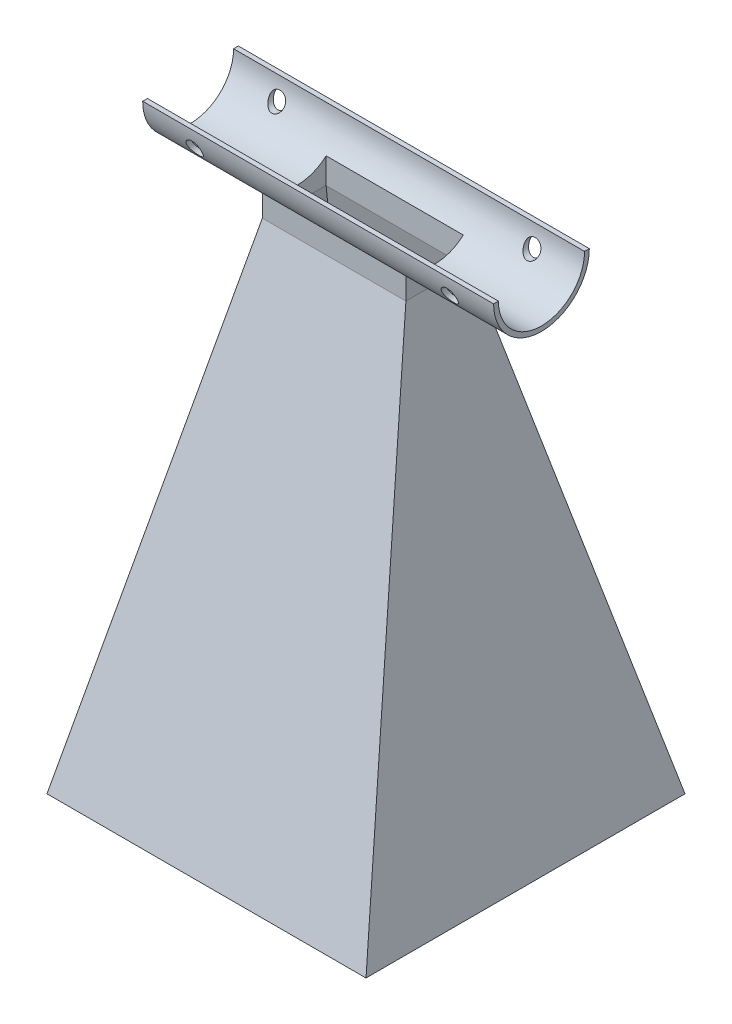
ISO-10303-21;
HEADER;
FILE_DESCRIPTION(('STEP AP214'),'2;1');
FILE_NAME('part.step','',(''),(''),'','','');
FILE_SCHEMA(('AUTOMOTIVE_DESIGN { 1 0 10303 214 1 1 1 1 }'));
ENDSEC;
DATA;
#1=APPLICATION_CONTEXT('core data for automotive mechanical design processes');
#2=APPLICATION_PROTOCOL_DEFINITION('international standard','automotive_design',2000,#1);
#3=PRODUCT_CONTEXT('',#1,'mechanical');
#4=PRODUCT('Part','Part','',(#3));
#5=PRODUCT_RELATED_PRODUCT_CATEGORY('part','',(#4));
#6=PRODUCT_DEFINITION_FORMATION('','',#4);
#7=PRODUCT_DEFINITION_CONTEXT('part definition',#1,'design');
#8=PRODUCT_DEFINITION('design','',#6,#7);
#9=PRODUCT_DEFINITION_SHAPE('','',#8);
#10=(LENGTH_UNIT() NAMED_UNIT(*) SI_UNIT(.MILLI.,.METRE.));
#11=(NAMED_UNIT(*) PLANE_ANGLE_UNIT() SI_UNIT($,.RADIAN.));
#12=(NAMED_UNIT(*) SI_UNIT($,.STERADIAN.) SOLID_ANGLE_UNIT());
#13=UNCERTAINTY_MEASURE_WITH_UNIT(LENGTH_MEASURE(1.E-05),#10,'distance_accuracy_value','');
#14=(GEOMETRIC_REPRESENTATION_CONTEXT(3) GLOBAL_UNCERTAINTY_ASSIGNED_CONTEXT((#13)) GLOBAL_UNIT_ASSIGNED_CONTEXT((#10,
#11,#12)) REPRESENTATION_CONTEXT('',''));
#15=CARTESIAN_POINT('',(0.,0.,0.));
#16=DIRECTION('',(0.,0.,1.));
#17=DIRECTION('',(1.,0.,0.));
#18=AXIS2_PLACEMENT_3D('',#15,#16,#17);
#19=CARTESIAN_POINT('',(-55.,168.,15.));
#20=DIRECTION('',(0.,1.,0.));
#21=DIRECTION('',(0.,0.,1.));
#22=AXIS2_PLACEMENT_3D('',#19,#20,#21);
#23=PLANE('',#22);
#24=DIRECTION('',(0.,0.,1.));
#25=VECTOR('',#24,1.);
#26=CARTESIAN_POINT('',(-55.,168.,15.));
#27=LINE('',#26,#25);
#28=CARTESIAN_POINT('',(-55.,168.,-15.));
#29=VERTEX_POINT('',#28);
#30=CARTESIAN_POINT('',(-55.,168.,-13.5));
#31=VERTEX_POINT('',#30);
#32=EDGE_CURVE('E243',#29,#31,#27,.T.);
#33=ORIENTED_EDGE('',*,*,#32,.T.);
#34=DIRECTION('',(1.,0.,0.));
#35=VECTOR('',#34,1.);
#36=CARTESIAN_POINT('',(-55.,168.,-13.5));
#37=LINE('',#36,#35);
#38=CARTESIAN_POINT('',(55.,168.,-13.5));
#39=VERTEX_POINT('',#38);
#40=EDGE_CURVE('E225',#31,#39,#37,.T.);
#41=ORIENTED_EDGE('',*,*,#40,.T.);
#42=DIRECTION('',(0.,0.,1.));
#43=VECTOR('',#42,1.);
#44=CARTESIAN_POINT('',(55.,168.,15.));
#45=LINE('',#44,#43);
#46=CARTESIAN_POINT('',(55.,168.,-15.));
#47=VERTEX_POINT('',#46);
#48=EDGE_CURVE('E236',#47,#39,#45,.T.);
#49=ORIENTED_EDGE('',*,*,#48,.F.);
#50=DIRECTION('',(1.,0.,0.));
#51=VECTOR('',#50,1.);
#52=CARTESIAN_POINT('',(-55.,168.,-15.));
#53=LINE('',#52,#51);
#54=EDGE_CURVE('E246',#29,#47,#53,.T.);
#55=ORIENTED_EDGE('',*,*,#54,.F.);
#56=EDGE_LOOP('',(#33,#41,#49,#55));
#57=FACE_BOUND('',#56,.T.);
#58=ADVANCED_FACE('F67',(#57),#23,.T.);
#59=CARTESIAN_POINT('',(0.,0.,0.));
#60=DIRECTION('',(0.,-1.,0.));
#61=DIRECTION('',(0.,0.,-1.));
#62=AXIS2_PLACEMENT_3D('',#59,#60,#61);
#63=PLANE('',#62);
#64=DIRECTION('',(0.,0.,-1.));
#65=VECTOR('',#64,1.);
#66=CARTESIAN_POINT('',(50.,0.,50.));
#67=LINE('',#66,#65);
#68=CARTESIAN_POINT('',(50.,0.,50.));
#69=VERTEX_POINT('',#68);
#70=CARTESIAN_POINT('',(50.,0.,-50.));
#71=VERTEX_POINT('',#70);
#72=EDGE_CURVE('E387',#69,#71,#67,.T.);
#73=ORIENTED_EDGE('',*,*,#72,.F.);
#74=DIRECTION('',(1.,0.,0.));
#75=VECTOR('',#74,1.);
#76=CARTESIAN_POINT('',(-50.,0.,50.));
#77=LINE('',#76,#75);
#78=CARTESIAN_POINT('',(-50.,0.,50.));
#79=VERTEX_POINT('',#78);
#80=EDGE_CURVE('E407',#79,#69,#77,.T.);
#81=ORIENTED_EDGE('',*,*,#80,.F.);
#82=DIRECTION('',(0.,0.,1.));
#83=VECTOR('',#82,1.);
#84=CARTESIAN_POINT('',(-50.,0.,50.));
#85=LINE('',#84,#83);
#86=CARTESIAN_POINT('',(-50.,0.,-50.));
#87=VERTEX_POINT('',#86);
#88=EDGE_CURVE('E337',#87,#79,#85,.T.);
#89=ORIENTED_EDGE('',*,*,#88,.F.);
#90=DIRECTION('',(-1.,0.,0.));
#91=VECTOR('',#90,1.);
#92=CARTESIAN_POINT('',(-50.,0.,-50.));
#93=LINE('',#92,#91);
#94=EDGE_CURVE('E507',#71,#87,#93,.T.);
#95=ORIENTED_EDGE('',*,*,#94,.F.);
#96=EDGE_LOOP('',(#73,#81,#89,#95));
#97=FACE_BOUND('',#96,.T.);
#98=DIRECTION('',(1.,0.,0.));
#99=VECTOR('',#98,1.);
#100=CARTESIAN_POINT('',(0.,0.,48.9650550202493));
#101=LINE('',#100,#99);
#102=CARTESIAN_POINT('',(-48.9833333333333,0.,48.9650550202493));
#103=VERTEX_POINT('',#102);
#104=CARTESIAN_POINT('',(48.9833333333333,0.,48.9650550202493));
#105=VERTEX_POINT('',#104);
#106=EDGE_CURVE('E280',#103,#105,#101,.T.);
#107=ORIENTED_EDGE('',*,*,#106,.T.);
#108=DIRECTION('',(0.,0.,-1.));
#109=VECTOR('',#108,1.);
#110=CARTESIAN_POINT('',(48.9833333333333,0.,0.));
#111=LINE('',#110,#109);
#112=CARTESIAN_POINT('',(48.9833333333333,0.,-48.9650550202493));
#113=VERTEX_POINT('',#112);
#114=EDGE_CURVE('E278',#105,#113,#111,.T.);
#115=ORIENTED_EDGE('',*,*,#114,.T.);
#116=DIRECTION('',(-1.,0.,0.));
#117=VECTOR('',#116,1.);
#118=CARTESIAN_POINT('',(0.,0.,-48.9650550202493));
#119=LINE('',#118,#117);
#120=CARTESIAN_POINT('',(-48.9833333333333,0.,-48.9650550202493));
#121=VERTEX_POINT('',#120);
#122=EDGE_CURVE('E287',#113,#121,#119,.T.);
#123=ORIENTED_EDGE('',*,*,#122,.T.);
#124=DIRECTION('',(0.,0.,1.));
#125=VECTOR('',#124,1.);
#126=CARTESIAN_POINT('',(-48.9833333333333,0.,0.));
#127=LINE('',#126,#125);
#128=EDGE_CURVE('E284',#121,#103,#127,.T.);
#129=ORIENTED_EDGE('',*,*,#128,.T.);
#130=EDGE_LOOP('',(#107,#115,#123,#129));
#131=FACE_BOUND('',#130,.T.);
#132=ADVANCED_FACE('F69',(#97,#131),#63,.T.);
#133=CARTESIAN_POINT('',(0.,12.448132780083,46.6804979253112));
#134=DIRECTION('',(0.,0.257662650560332,0.966234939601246));
#135=DIRECTION('',(0.,-0.966234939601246,0.257662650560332));
#136=AXIS2_PLACEMENT_3D('',#133,#134,#135);
#137=PLANE('',#136);
#138=DIRECTION('',(-0.174427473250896,-0.951422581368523,0.253712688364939));
#139=VECTOR('',#138,1.);
#140=CARTESIAN_POINT('',(-22.5,150.,10.));
#141=LINE('',#140,#139);
#142=CARTESIAN_POINT('',(-22.5,150.,10.));
#143=VERTEX_POINT('',#142);
#144=EDGE_CURVE('E304',#143,#79,#141,.T.);
#145=ORIENTED_EDGE('',*,*,#144,.T.);
#146=ORIENTED_EDGE('',*,*,#80,.T.);
#147=DIRECTION('',(0.174427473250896,-0.951422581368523,0.253712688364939));
#148=VECTOR('',#147,1.);
#149=CARTESIAN_POINT('',(22.5,150.,10.));
#150=LINE('',#149,#148);
#151=CARTESIAN_POINT('',(22.5,150.,10.));
#152=VERTEX_POINT('',#151);
#153=EDGE_CURVE('E369',#152,#69,#150,.T.);
#154=ORIENTED_EDGE('',*,*,#153,.F.);
#155=DIRECTION('',(1.,0.,0.));
#156=VECTOR('',#155,1.);
#157=CARTESIAN_POINT('',(22.5,150.,10.));
#158=LINE('',#157,#156);
#159=EDGE_CURVE('E298',#143,#152,#158,.T.);
#160=ORIENTED_EDGE('',*,*,#159,.F.);
#161=EDGE_LOOP('',(#145,#146,#154,#160));
#162=FACE_BOUND('',#161,.T.);
#163=ADVANCED_FACE('F306',(#162),#137,.T.);
#164=CARTESIAN_POINT('',(48.3740929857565,8.86858371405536,0.));
#165=DIRECTION('',(0.983606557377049,0.180327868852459,0.));
#166=DIRECTION('',(-0.180327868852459,0.983606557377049,0.));
#167=AXIS2_PLACEMENT_3D('',#164,#165,#166);
#168=PLANE('',#167);
#169=ORIENTED_EDGE('',*,*,#153,.T.);
#170=ORIENTED_EDGE('',*,*,#72,.T.);
#171=DIRECTION('',(0.174427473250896,-0.951422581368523,-0.253712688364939));
#172=VECTOR('',#171,1.);
#173=CARTESIAN_POINT('',(22.5,150.,-10.));
#174=LINE('',#173,#172);
#175=CARTESIAN_POINT('',(22.5,150.,-10.));
#176=VERTEX_POINT('',#175);
#177=EDGE_CURVE('E368',#176,#71,#174,.T.);
#178=ORIENTED_EDGE('',*,*,#177,.F.);
#179=DIRECTION('',(0.,0.,-1.));
#180=VECTOR('',#179,1.);
#181=CARTESIAN_POINT('',(22.5,150.,10.));
#182=LINE('',#181,#180);
#183=EDGE_CURVE('E392',#152,#176,#182,.T.);
#184=ORIENTED_EDGE('',*,*,#183,.F.);
#185=EDGE_LOOP('',(#169,#170,#178,#184));
#186=FACE_BOUND('',#185,.T.);
#187=ADVANCED_FACE('F316',(#186),#168,.T.);
#188=CARTESIAN_POINT('',(-48.3740929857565,8.86858371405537,0.));
#189=DIRECTION('',(-0.983606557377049,0.180327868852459,0.));
#190=DIRECTION('',(-0.180327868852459,-0.983606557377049,0.));
#191=AXIS2_PLACEMENT_3D('',#188,#189,#190);
#192=PLANE('',#191);
#193=DIRECTION('',(-0.174427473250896,-0.951422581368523,-0.253712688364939));
#194=VECTOR('',#193,1.);
#195=CARTESIAN_POINT('',(-22.5,150.,-9.99999999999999));
#196=LINE('',#195,#194);
#197=CARTESIAN_POINT('',(-22.5,150.,-9.99999999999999));
#198=VERTEX_POINT('',#197);
#199=EDGE_CURVE('E361',#198,#87,#196,.T.);
#200=ORIENTED_EDGE('',*,*,#199,.T.);
#201=ORIENTED_EDGE('',*,*,#88,.T.);
#202=ORIENTED_EDGE('',*,*,#144,.F.);
#203=DIRECTION('',(0.,0.,1.));
#204=VECTOR('',#203,1.);
#205=CARTESIAN_POINT('',(-22.5,150.,10.));
#206=LINE('',#205,#204);
#207=EDGE_CURVE('E283',#198,#143,#206,.T.);
#208=ORIENTED_EDGE('',*,*,#207,.F.);
#209=EDGE_LOOP('',(#200,#201,#202,#208));
#210=FACE_BOUND('',#209,.T.);
#211=ADVANCED_FACE('F343',(#210),#192,.T.);
#212=CARTESIAN_POINT('',(0.,12.448132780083,-46.6804979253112));
#213=DIRECTION('',(0.,0.257662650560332,-0.966234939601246));
#214=DIRECTION('',(0.,0.966234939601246,0.257662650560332));
#215=AXIS2_PLACEMENT_3D('',#212,#213,#214);
#216=PLANE('',#215);
#217=ORIENTED_EDGE('',*,*,#177,.T.);
#218=ORIENTED_EDGE('',*,*,#94,.T.);
#219=ORIENTED_EDGE('',*,*,#199,.F.);
#220=DIRECTION('',(-1.,0.,0.));
#221=VECTOR('',#220,1.);
#222=CARTESIAN_POINT('',(22.5,150.,-10.));
#223=LINE('',#222,#221);
#224=EDGE_CURVE('E376',#176,#198,#223,.T.);
#225=ORIENTED_EDGE('',*,*,#224,.F.);
#226=EDGE_LOOP('',(#217,#218,#219,#225));
#227=FACE_BOUND('',#226,.T.);
#228=ADVANCED_FACE('F351',(#227),#216,.T.);
#229=CARTESIAN_POINT('',(0.,12.1904701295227,45.71426298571));
#230=DIRECTION('',(0.,0.257662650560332,0.966234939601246));
#231=DIRECTION('',(0.,-0.966234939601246,0.257662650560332));
#232=AXIS2_PLACEMENT_3D('',#229,#230,#231);
#233=PLANE('',#232);
#234=DIRECTION('',(1.,0.,0.));
#235=VECTOR('',#234,1.);
#236=CARTESIAN_POINT('',(-2.67716365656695E-13,149.868956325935,9.00000000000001));
#237=LINE('',#236,#235);
#238=CARTESIAN_POINT('',(-21.5,149.868956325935,9.));
#239=VERTEX_POINT('',#238);
#240=CARTESIAN_POINT('',(21.5,149.868956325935,8.99999999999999));
#241=VERTEX_POINT('',#240);
#242=EDGE_CURVE('E613',#239,#241,#237,.T.);
#243=ORIENTED_EDGE('',*,*,#242,.T.);
#244=DIRECTION('',(0.,0.966234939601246,-0.257662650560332));
#245=VECTOR('',#244,1.);
#246=CARTESIAN_POINT('',(21.5,12.1904701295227,45.71426298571));
#247=LINE('',#246,#245);
#248=CARTESIAN_POINT('',(21.5,149.909090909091,8.98929744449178));
#249=VERTEX_POINT('',#248);
#250=EDGE_CURVE('E216',#241,#249,#247,.T.);
#251=ORIENTED_EDGE('',*,*,#250,.T.);
#252=DIRECTION('',(0.174427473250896,-0.951422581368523,0.253712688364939));
#253=VECTOR('',#252,1.);
#254=CARTESIAN_POINT('',(45.3260959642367,19.9485674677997,43.6454370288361));
#255=LINE('',#254,#253);
#256=EDGE_CURVE('E273',#249,#105,#255,.T.);
#257=ORIENTED_EDGE('',*,*,#256,.T.);
#258=ORIENTED_EDGE('',*,*,#106,.F.);
#259=DIRECTION('',(-0.174427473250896,-0.951422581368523,0.253712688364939));
#260=VECTOR('',#259,1.);
#261=CARTESIAN_POINT('',(-45.3260959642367,19.9485674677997,43.6454370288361));
#262=LINE('',#261,#260);
#263=CARTESIAN_POINT('',(-21.5,149.909090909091,8.98929744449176));
#264=VERTEX_POINT('',#263);
#265=EDGE_CURVE('E257',#264,#103,#262,.T.);
#266=ORIENTED_EDGE('',*,*,#265,.F.);
#267=DIRECTION('',(0.,-0.966234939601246,0.257662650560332));
#268=VECTOR('',#267,1.);
#269=CARTESIAN_POINT('',(-21.5,12.1904701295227,45.71426298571));
#270=LINE('',#269,#268);
#271=EDGE_CURVE('E610',#264,#239,#270,.T.);
#272=ORIENTED_EDGE('',*,*,#271,.T.);
#273=EDGE_LOOP('',(#243,#251,#257,#258,#266,#272));
#274=FACE_BOUND('',#273,.T.);
#275=ADVANCED_FACE('F628',(#274),#233,.F.);
#276=CARTESIAN_POINT('',(47.3904864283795,8.6882558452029,0.));
#277=DIRECTION('',(0.983606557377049,0.180327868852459,0.));
#278=DIRECTION('',(-0.180327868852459,0.983606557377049,0.));
#279=AXIS2_PLACEMENT_3D('',#276,#277,#278);
#280=PLANE('',#279);
#281=ORIENTED_EDGE('',*,*,#256,.F.);
#282=DIRECTION('',(0.,0.,-1.));
#283=VECTOR('',#282,1.);
#284=CARTESIAN_POINT('',(21.5,149.909090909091,0.));
#285=LINE('',#284,#283);
#286=CARTESIAN_POINT('',(21.5,149.909090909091,-8.98929744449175));
#287=VERTEX_POINT('',#286);
#288=EDGE_CURVE('E221',#249,#287,#285,.T.);
#289=ORIENTED_EDGE('',*,*,#288,.T.);
#290=DIRECTION('',(0.174427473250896,-0.951422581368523,-0.253712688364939));
#291=VECTOR('',#290,1.);
#292=CARTESIAN_POINT('',(45.3260959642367,19.9485674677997,-43.6454370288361));
#293=LINE('',#292,#291);
#294=EDGE_CURVE('E276',#287,#113,#293,.T.);
#295=ORIENTED_EDGE('',*,*,#294,.T.);
#296=ORIENTED_EDGE('',*,*,#114,.F.);
#297=EDGE_LOOP('',(#281,#289,#295,#296));
#298=FACE_BOUND('',#297,.T.);
#299=ADVANCED_FACE('F619',(#298),#280,.F.);
#300=CARTESIAN_POINT('',(-47.3904864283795,8.68825584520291,0.));
#301=DIRECTION('',(-0.983606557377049,0.180327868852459,0.));
#302=DIRECTION('',(-0.180327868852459,-0.983606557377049,0.));
#303=AXIS2_PLACEMENT_3D('',#300,#301,#302);
#304=PLANE('',#303);
#305=DIRECTION('',(-0.174427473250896,-0.951422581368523,-0.253712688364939));
#306=VECTOR('',#305,1.);
#307=CARTESIAN_POINT('',(-45.3260959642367,19.9485674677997,-43.6454370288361));
#308=LINE('',#307,#306);
#309=CARTESIAN_POINT('',(-21.5,149.909090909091,-8.98929744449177));
#310=VERTEX_POINT('',#309);
#311=EDGE_CURVE('E275',#310,#121,#308,.T.);
#312=ORIENTED_EDGE('',*,*,#311,.F.);
#313=DIRECTION('',(0.,0.,1.));
#314=VECTOR('',#313,1.);
#315=CARTESIAN_POINT('',(-21.5,149.909090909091,0.));
#316=LINE('',#315,#314);
#317=EDGE_CURVE('E89',#310,#264,#316,.T.);
#318=ORIENTED_EDGE('',*,*,#317,.T.);
#319=ORIENTED_EDGE('',*,*,#265,.T.);
#320=ORIENTED_EDGE('',*,*,#128,.F.);
#321=EDGE_LOOP('',(#312,#318,#319,#320));
#322=FACE_BOUND('',#321,.T.);
#323=ADVANCED_FACE('F642',(#322),#304,.F.);
#324=CARTESIAN_POINT('',(0.,12.1904701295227,-45.71426298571));
#325=DIRECTION('',(0.,0.257662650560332,-0.966234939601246));
#326=DIRECTION('',(0.,0.966234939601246,0.257662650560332));
#327=AXIS2_PLACEMENT_3D('',#324,#325,#326);
#328=PLANE('',#327);
#329=ORIENTED_EDGE('',*,*,#294,.F.);
#330=DIRECTION('',(0.,-0.966234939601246,-0.257662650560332));
#331=VECTOR('',#330,1.);
#332=CARTESIAN_POINT('',(21.5,12.1904701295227,-45.71426298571));
#333=LINE('',#332,#331);
#334=CARTESIAN_POINT('',(21.5,149.868956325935,-8.99999999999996));
#335=VERTEX_POINT('',#334);
#336=EDGE_CURVE('E214',#287,#335,#333,.T.);
#337=ORIENTED_EDGE('',*,*,#336,.T.);
#338=DIRECTION('',(-1.,0.,0.));
#339=VECTOR('',#338,1.);
#340=CARTESIAN_POINT('',(0.,149.868956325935,-8.99999999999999));
#341=LINE('',#340,#339);
#342=CARTESIAN_POINT('',(-21.5,149.868956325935,-8.99999999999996));
#343=VERTEX_POINT('',#342);
#344=EDGE_CURVE('E200',#335,#343,#341,.T.);
#345=ORIENTED_EDGE('',*,*,#344,.T.);
#346=DIRECTION('',(0.,0.966234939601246,0.257662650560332));
#347=VECTOR('',#346,1.);
#348=CARTESIAN_POINT('',(-21.5,12.1904701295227,-45.71426298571));
#349=LINE('',#348,#347);
#350=EDGE_CURVE('E206',#343,#310,#349,.T.);
#351=ORIENTED_EDGE('',*,*,#350,.T.);
#352=ORIENTED_EDGE('',*,*,#311,.T.);
#353=ORIENTED_EDGE('',*,*,#122,.F.);
#354=EDGE_LOOP('',(#329,#337,#345,#351,#352,#353));
#355=FACE_BOUND('',#354,.T.);
#356=ADVANCED_FACE('F213',(#355),#328,.F.);
#357=CARTESIAN_POINT('',(22.5,168.001,-10.));
#358=DIRECTION('',(0.,0.,1.));
#359=DIRECTION('',(1.,0.,0.));
#360=AXIS2_PLACEMENT_3D('',#357,#358,#359);
#361=PLANE('',#360);
#362=DIRECTION('',(0.,-1.,0.));
#363=VECTOR('',#362,1.);
#364=CARTESIAN_POINT('',(-22.5,168.001,-9.99999999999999));
#365=LINE('',#364,#363);
#366=CARTESIAN_POINT('',(-22.5,156.819660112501,-10.));
#367=VERTEX_POINT('',#366);
#368=EDGE_CURVE('E264',#367,#198,#365,.T.);
#369=ORIENTED_EDGE('',*,*,#368,.F.);
#370=DIRECTION('',(1.,0.,0.));
#371=VECTOR('',#370,1.);
#372=CARTESIAN_POINT('',(-55.,156.819660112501,-9.99999999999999));
#373=LINE('',#372,#371);
#374=CARTESIAN_POINT('',(22.5,156.819660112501,-10.));
#375=VERTEX_POINT('',#374);
#376=EDGE_CURVE('E250',#367,#375,#373,.T.);
#377=ORIENTED_EDGE('',*,*,#376,.T.);
#378=DIRECTION('',(0.,-1.,0.));
#379=VECTOR('',#378,1.);
#380=CARTESIAN_POINT('',(22.5,168.001,-10.));
#381=LINE('',#380,#379);
#382=EDGE_CURVE('E260',#375,#176,#381,.T.);
#383=ORIENTED_EDGE('',*,*,#382,.T.);
#384=ORIENTED_EDGE('',*,*,#224,.T.);
#385=EDGE_LOOP('',(#369,#377,#383,#384));
#386=FACE_BOUND('',#385,.T.);
#387=ADVANCED_FACE('F442',(#386),#361,.F.);
#388=CARTESIAN_POINT('',(-22.5,168.001,-9.99999999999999));
#389=DIRECTION('',(1.,0.,0.));
#390=DIRECTION('',(0.,0.,-1.));
#391=AXIS2_PLACEMENT_3D('',#388,#389,#390);
#392=PLANE('',#391);
#393=DIRECTION('',(0.,-1.,0.));
#394=VECTOR('',#393,1.);
#395=CARTESIAN_POINT('',(-22.5,168.001,10.));
#396=LINE('',#395,#394);
#397=CARTESIAN_POINT('',(-22.5,156.819660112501,10.));
#398=VERTEX_POINT('',#397);
#399=EDGE_CURVE('E268',#398,#143,#396,.T.);
#400=ORIENTED_EDGE('',*,*,#399,.F.);
#401=CARTESIAN_POINT('',(-22.5,168.,0.));
#402=DIRECTION('',(1.,0.,0.));
#403=DIRECTION('',(0.,0.,-1.));
#404=AXIS2_PLACEMENT_3D('',#401,#402,#403);
#405=CIRCLE('',#404,15.);
#406=EDGE_CURVE('E261',#398,#367,#405,.T.);
#407=ORIENTED_EDGE('',*,*,#406,.T.);
#408=ORIENTED_EDGE('',*,*,#368,.T.);
#409=ORIENTED_EDGE('',*,*,#207,.T.);
#410=EDGE_LOOP('',(#400,#407,#408,#409));
#411=FACE_BOUND('',#410,.T.);
#412=ADVANCED_FACE('F436',(#411),#392,.F.);
#413=CARTESIAN_POINT('',(-22.5,168.001,10.));
#414=DIRECTION('',(0.,0.,-1.));
#415=DIRECTION('',(-1.,0.,0.));
#416=AXIS2_PLACEMENT_3D('',#413,#414,#415);
#417=PLANE('',#416);
#418=DIRECTION('',(0.,-1.,0.));
#419=VECTOR('',#418,1.);
#420=CARTESIAN_POINT('',(22.5,168.001,10.));
#421=LINE('',#420,#419);
#422=CARTESIAN_POINT('',(22.5,156.819660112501,10.));
#423=VERTEX_POINT('',#422);
#424=EDGE_CURVE('E204',#423,#152,#421,.T.);
#425=ORIENTED_EDGE('',*,*,#424,.F.);
#426=DIRECTION('',(1.,0.,0.));
#427=VECTOR('',#426,1.);
#428=CARTESIAN_POINT('',(-55.,156.819660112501,10.));
#429=LINE('',#428,#427);
#430=EDGE_CURVE('E265',#423,#398,#429,.F.);
#431=ORIENTED_EDGE('',*,*,#430,.T.);
#432=ORIENTED_EDGE('',*,*,#399,.T.);
#433=ORIENTED_EDGE('',*,*,#159,.T.);
#434=EDGE_LOOP('',(#425,#431,#432,#433));
#435=FACE_BOUND('',#434,.T.);
#436=ADVANCED_FACE('F415',(#435),#417,.F.);
#437=CARTESIAN_POINT('',(22.5,168.001,10.));
#438=DIRECTION('',(-1.,0.,0.));
#439=DIRECTION('',(0.,0.,1.));
#440=AXIS2_PLACEMENT_3D('',#437,#438,#439);
#441=PLANE('',#440);
#442=ORIENTED_EDGE('',*,*,#382,.F.);
#443=CARTESIAN_POINT('',(22.5,168.,0.));
#444=DIRECTION('',(-1.,0.,0.));
#445=DIRECTION('',(0.,0.,1.));
#446=AXIS2_PLACEMENT_3D('',#443,#444,#445);
#447=CIRCLE('',#446,15.);
#448=EDGE_CURVE('E269',#375,#423,#447,.T.);
#449=ORIENTED_EDGE('',*,*,#448,.T.);
#450=ORIENTED_EDGE('',*,*,#424,.T.);
#451=ORIENTED_EDGE('',*,*,#183,.T.);
#452=EDGE_LOOP('',(#442,#449,#450,#451));
#453=FACE_BOUND('',#452,.T.);
#454=ADVANCED_FACE('F411',(#453),#441,.F.);
#455=CARTESIAN_POINT('',(-55.,168.,0.));
#456=DIRECTION('',(1.,0.,0.));
#457=DIRECTION('',(0.,0.,-1.));
#458=AXIS2_PLACEMENT_3D('',#455,#456,#457);
#459=CYLINDRICAL_SURFACE('',#458,15.);
#460=CARTESIAN_POINT('',(-37.5,162.,-13.7477270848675));
#461=CARTESIAN_POINT('',(-37.500004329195,161.843867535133,-13.6795812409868));
#462=CARTESIAN_POINT('',(-37.5146537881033,161.688835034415,-13.6087234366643));
#463=CARTESIAN_POINT('',(-37.5717955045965,161.385411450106,-13.4638622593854));
#464=CARTESIAN_POINT('',(-37.6143204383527,161.237028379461,-13.3898552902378));
#465=CARTESIAN_POINT('',(-37.7255796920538,160.950937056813,-13.2414740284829));
#466=CARTESIAN_POINT('',(-37.7942756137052,160.813213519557,-13.1671004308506));
#467=CARTESIAN_POINT('',(-37.9565062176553,160.551611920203,-13.0209057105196));
#468=CARTESIAN_POINT('',(-38.0500488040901,160.427738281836,-12.9490854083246));
#469=CARTESIAN_POINT('',(-38.2611525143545,160.196944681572,-12.8113421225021));
#470=CARTESIAN_POINT('',(-38.378839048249,160.090118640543,-12.7454526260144));
#471=CARTESIAN_POINT('',(-38.6359829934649,159.89880756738,-12.6247171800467));
#472=CARTESIAN_POINT('',(-38.7753970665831,159.814278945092,-12.5698497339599));
#473=CARTESIAN_POINT('',(-39.0314626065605,159.692151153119,-12.4893336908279));
#474=CARTESIAN_POINT('',(-39.1438077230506,159.648038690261,-12.4597996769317));
#475=CARTESIAN_POINT('',(-39.3757735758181,159.576151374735,-12.4113120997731));
#476=CARTESIAN_POINT('',(-39.4953877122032,159.548361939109,-12.3923490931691));
#477=CARTESIAN_POINT('',(-39.739197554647,159.510571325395,-12.3664929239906));
#478=CARTESIAN_POINT('',(-39.8634094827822,159.500640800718,-12.3596477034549));
#479=CARTESIAN_POINT('',(-40.111975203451,159.499419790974,-12.3588081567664));
#480=CARTESIAN_POINT('',(-40.2363289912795,159.508128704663,-12.3648134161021));
#481=CARTESIAN_POINT('',(-40.4733629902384,159.542487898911,-12.3883360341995));
#482=CARTESIAN_POINT('',(-40.5862836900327,159.567030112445,-12.405100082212));
#483=CARTESIAN_POINT('',(-40.8059857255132,159.630721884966,-12.4481584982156));
#484=CARTESIAN_POINT('',(-40.9127658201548,159.669874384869,-12.4744547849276));
#485=CARTESIAN_POINT('',(-41.124581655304,159.764026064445,-12.5368297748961));
#486=CARTESIAN_POINT('',(-41.229092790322,159.819861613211,-12.5734165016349));
#487=CARTESIAN_POINT('',(-41.4273721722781,159.944197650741,-12.6534388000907));
#488=CARTESIAN_POINT('',(-41.5211353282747,160.012704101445,-12.6968775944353));
#489=CARTESIAN_POINT('',(-41.7104178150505,160.171883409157,-12.7957271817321));
#490=CARTESIAN_POINT('',(-41.8040074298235,160.264344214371,-12.851952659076));
#491=CARTESIAN_POINT('',(-41.974635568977,160.461231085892,-12.968425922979));
#492=CARTESIAN_POINT('',(-42.0516636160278,160.565664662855,-13.028676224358));
#493=CARTESIAN_POINT('',(-42.1983519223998,160.800380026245,-13.1600174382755));
#494=CARTESIAN_POINT('',(-42.2652858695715,160.932208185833,-13.2314048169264));
#495=CARTESIAN_POINT('',(-42.3750491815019,161.205725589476,-13.3739164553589));
#496=CARTESIAN_POINT('',(-42.4178681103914,161.347419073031,-13.4450405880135));
#497=CARTESIAN_POINT('',(-42.4796829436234,161.645575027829,-13.5886027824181));
#498=CARTESIAN_POINT('',(-42.4972073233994,161.802420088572,-13.6608906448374));
#499=CARTESIAN_POINT('',(-42.5021747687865,162.118975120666,-13.8001236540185));
#500=CARTESIAN_POINT('',(-42.4896249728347,162.278684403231,-13.8670700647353));
#501=CARTESIAN_POINT('',(-42.4346255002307,162.588385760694,-13.9907462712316));
#502=CARTESIAN_POINT('',(-42.3935550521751,162.738490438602,-14.0478013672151));
#503=CARTESIAN_POINT('',(-42.2829206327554,163.030852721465,-14.1538592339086));
#504=CARTESIAN_POINT('',(-42.2133729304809,163.173114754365,-14.2028665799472));
#505=CARTESIAN_POINT('',(-42.0540114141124,163.43257187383,-14.2883075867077));
#506=CARTESIAN_POINT('',(-41.9663664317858,163.550867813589,-14.3254483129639));
#507=CARTESIAN_POINT('',(-41.7703354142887,163.771339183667,-14.3920708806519));
#508=CARTESIAN_POINT('',(-41.6619570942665,163.873520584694,-14.4215555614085));
#509=CARTESIAN_POINT('',(-41.4348355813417,164.052031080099,-14.4714074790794));
#510=CARTESIAN_POINT('',(-41.3171297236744,164.129557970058,-14.4922215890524));
#511=CARTESIAN_POINT('',(-41.0696173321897,164.264009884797,-14.5274646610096));
#512=CARTESIAN_POINT('',(-40.9398129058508,164.320938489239,-14.5418947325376));
#513=CARTESIAN_POINT('',(-40.6756805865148,164.410889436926,-14.5643533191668));
#514=CARTESIAN_POINT('',(-40.5415760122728,164.444527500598,-14.572547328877));
#515=CARTESIAN_POINT('',(-40.269440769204,164.489259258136,-14.5833891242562));
#516=CARTESIAN_POINT('',(-40.1314103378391,164.500354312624,-14.5860372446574));
#517=CARTESIAN_POINT('',(-39.856583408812,164.499631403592,-14.5858636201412));
#518=CARTESIAN_POINT('',(-39.7197863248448,164.488005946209,-14.5830878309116));
#519=CARTESIAN_POINT('',(-39.4501467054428,164.442611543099,-14.5720803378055));
#520=CARTESIAN_POINT('',(-39.3173040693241,164.408843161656,-14.5638487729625));
#521=CARTESIAN_POINT('',(-39.0593519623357,164.320295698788,-14.5417276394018));
#522=CARTESIAN_POINT('',(-38.9342408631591,164.265521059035,-14.5278392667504));
#523=CARTESIAN_POINT('',(-38.6951929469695,164.136798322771,-14.4941394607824));
#524=CARTESIAN_POINT('',(-38.5812558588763,164.062850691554,-14.4743281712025));
#525=CARTESIAN_POINT('',(-38.3667914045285,163.897652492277,-14.4283791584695));
#526=CARTESIAN_POINT('',(-38.2663687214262,163.806278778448,-14.4021960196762));
#527=CARTESIAN_POINT('',(-38.082402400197,163.609643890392,-14.343475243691));
#528=CARTESIAN_POINT('',(-37.9988613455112,163.504380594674,-14.3109366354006));
#529=CARTESIAN_POINT('',(-37.8486649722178,163.280753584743,-14.2387788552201));
#530=CARTESIAN_POINT('',(-37.7824566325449,163.162138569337,-14.1990101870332));
#531=CARTESIAN_POINT('',(-37.6706466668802,162.917700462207,-14.1133617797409));
#532=CARTESIAN_POINT('',(-37.6250396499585,162.791879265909,-14.0674836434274));
#533=CARTESIAN_POINT('',(-37.5597144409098,162.554880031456,-13.9772812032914));
#534=CARTESIAN_POINT('',(-37.5372281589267,162.444178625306,-13.9336716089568));
#535=CARTESIAN_POINT('',(-37.5073679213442,162.222133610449,-13.8430726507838));
#536=CARTESIAN_POINT('',(-37.4999969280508,162.110789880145,-13.7960826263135));
#537=CARTESIAN_POINT('',(-37.5,162.,-13.7477270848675));
#538=B_SPLINE_CURVE_WITH_KNOTS('',3,(#460,#461,#462,#463,#464,#465,#466,#467,#468,#469,#470,
#471,#472,#473,#474,#475,#476,#477,#478,#479,#480,#481,#482,#483,#484,#485,#486,#487,#488,#489,
#490,#491,#492,#493,#494,#495,#496,#497,#498,#499,#500,#501,#502,#503,#504,#505,#506,#507,#508,
#509,#510,#511,#512,#513,#514,#515,#516,#517,#518,#519,#520,#521,#522,#523,#524,#525,#526,#527,
#528,#529,#530,#531,#532,#533,#534,#535,#536,#537),.UNSPECIFIED.,.T.,.F.,(4,2,2,2,2,2,2,2,2,2,2,
2,2,2,2,2,2,2,2,2,2,2,2,2,2,2,2,2,2,2,2,2,2,2,2,2,2,2,4),(0.,0.510613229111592,1.02182608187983,
1.53229174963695,2.04291999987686,2.55627097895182,3.06861082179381,3.43984004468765,
3.81073710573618,4.18309830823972,4.55544749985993,4.90421083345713,5.25304440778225,
5.62364477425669,5.99441996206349,6.42197203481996,6.84979379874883,7.34020188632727,
7.83082203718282,8.34897099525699,8.86699697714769,9.36157289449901,9.85586665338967,
10.309015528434,10.7619961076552,11.1873102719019,11.6125504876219,12.0260689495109,
12.4395624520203,12.849567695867,13.259562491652,13.669470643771,14.0793688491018,
14.4922788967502,14.9052520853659,15.3280100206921,15.7506572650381,16.1129118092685,
16.4752373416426),.UNSPECIFIED.);
#539=CARTESIAN_POINT('',(-37.5,162.,-13.7477270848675));
#540=VERTEX_POINT('',#539);
#541=EDGE_CURVE('E595',#540,#540,#538,.T.);
#542=ORIENTED_EDGE('',*,*,#541,.F.);
#543=EDGE_LOOP('',(#542));
#544=FACE_BOUND('',#543,.T.);
#545=CARTESIAN_POINT('',(-37.5,162.,13.7477270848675));
#546=CARTESIAN_POINT('',(-37.4999998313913,162.142090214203,13.8097416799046));
#547=CARTESIAN_POINT('',(-37.512127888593,162.285147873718,13.8695318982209));
#548=CARTESIAN_POINT('',(-37.5614194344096,162.569289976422,13.9832317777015));
#549=CARTESIAN_POINT('',(-37.5985730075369,162.710375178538,14.0371437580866));
#550=CARTESIAN_POINT('',(-37.6981900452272,162.98655216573,14.1381414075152));
#551=CARTESIAN_POINT('',(-37.7607366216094,163.121622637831,14.1852039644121));
#552=CARTESIAN_POINT('',(-37.9102447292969,163.380296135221,14.2715430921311));
#553=CARTESIAN_POINT('',(-37.9972016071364,163.503901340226,14.3108211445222));
#554=CARTESIAN_POINT('',(-38.187630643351,163.72790499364,14.3792263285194));
#555=CARTESIAN_POINT('',(-38.2898392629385,163.829237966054,14.4088128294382));
#556=CARTESIAN_POINT('',(-38.5112264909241,164.013524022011,14.4608852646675));
#557=CARTESIAN_POINT('',(-38.6304006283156,164.09648193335,14.4833730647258));
#558=CARTESIAN_POINT('',(-38.8764656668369,164.237606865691,14.5206579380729));
#559=CARTESIAN_POINT('',(-39.0027696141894,164.29671995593,14.5357550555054));
#560=CARTESIAN_POINT('',(-39.2639496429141,164.393241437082,14.5600064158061));
#561=CARTESIAN_POINT('',(-39.3988247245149,164.430652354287,14.5691613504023));
#562=CARTESIAN_POINT('',(-39.6707755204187,164.482021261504,14.5816500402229));
#563=CARTESIAN_POINT('',(-39.8077716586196,164.496377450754,14.5850826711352));
#564=CARTESIAN_POINT('',(-40.0822896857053,164.502413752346,14.5865315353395));
#565=CARTESIAN_POINT('',(-40.2198115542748,164.494094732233,14.5845479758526));
#566=CARTESIAN_POINT('',(-40.4908717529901,164.455140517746,14.5751282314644));
#567=CARTESIAN_POINT('',(-40.6244243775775,164.424599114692,14.5677149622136));
#568=CARTESIAN_POINT('',(-40.884372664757,164.342321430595,14.5472736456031));
#569=CARTESIAN_POINT('',(-41.0107684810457,164.290585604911,14.5342457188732));
#570=CARTESIAN_POINT('',(-41.2531982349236,164.1674918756,14.502272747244));
#571=CARTESIAN_POINT('',(-41.3692052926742,164.09608491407,14.4833128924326));
#572=CARTESIAN_POINT('',(-41.5873773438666,163.936112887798,14.4392410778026));
#573=CARTESIAN_POINT('',(-41.6895422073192,163.847547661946,14.4141290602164));
#574=CARTESIAN_POINT('',(-41.8786958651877,163.654977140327,14.3572615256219));
#575=CARTESIAN_POINT('',(-41.9654735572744,163.550788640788,14.3254250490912));
#576=CARTESIAN_POINT('',(-42.1203227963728,163.331271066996,14.2553930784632));
#577=CARTESIAN_POINT('',(-42.1883921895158,163.215940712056,14.2171968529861));
#578=CARTESIAN_POINT('',(-42.3066892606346,162.973639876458,14.1333884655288));
#579=CARTESIAN_POINT('',(-42.3562293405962,162.846406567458,14.0875678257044));
#580=CARTESIAN_POINT('',(-42.4337060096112,162.587650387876,13.9901964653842));
#581=CARTESIAN_POINT('',(-42.4616368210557,162.45612637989,13.9386442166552));
#582=CARTESIAN_POINT('',(-42.4972404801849,162.183879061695,13.8273530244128));
#583=CARTESIAN_POINT('',(-42.5035159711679,162.043101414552,13.7673022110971));
#584=CARTESIAN_POINT('',(-42.4927700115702,161.764216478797,13.643252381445));
#585=CARTESIAN_POINT('',(-42.4757407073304,161.626110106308,13.5792520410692));
#586=CARTESIAN_POINT('',(-42.4172286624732,161.34482633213,13.4437685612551));
#587=CARTESIAN_POINT('',(-42.3739050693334,161.202122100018,13.3720955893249));
#588=CARTESIAN_POINT('',(-42.2627415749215,160.926646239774,13.2284482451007));
#589=CARTESIAN_POINT('',(-42.1948836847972,160.793881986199,13.1564736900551));
#590=CARTESIAN_POINT('',(-42.0320830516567,160.53538685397,13.0116308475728));
#591=CARTESIAN_POINT('',(-41.9359889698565,160.410306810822,12.9388877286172));
#592=CARTESIAN_POINT('',(-41.7197295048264,160.178575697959,12.8001382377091));
#593=CARTESIAN_POINT('',(-41.599590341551,160.071904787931,12.7341246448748));
#594=CARTESIAN_POINT('',(-41.3664466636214,159.902686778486,12.6270046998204));
#595=CARTESIAN_POINT('',(-41.257775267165,159.835601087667,12.5836219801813));
#596=CARTESIAN_POINT('',(-41.0287293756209,159.717838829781,12.5064290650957));
#597=CARTESIAN_POINT('',(-40.9083637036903,159.667150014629,12.4726117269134));
#598=CARTESIAN_POINT('',(-40.6577078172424,159.584437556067,12.4169580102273));
#599=CARTESIAN_POINT('',(-40.5273553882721,159.552543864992,12.3952051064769));
#600=CARTESIAN_POINT('',(-40.2616567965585,159.510102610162,12.3661772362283));
#601=CARTESIAN_POINT('',(-40.1263143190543,159.499539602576,12.3588917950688));
#602=CARTESIAN_POINT('',(-39.8717081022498,159.50043635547,12.3595060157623));
#603=CARTESIAN_POINT('',(-39.7524220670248,159.509456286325,12.3657233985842));
#604=CARTESIAN_POINT('',(-39.5174736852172,159.54413614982,12.3894633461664));
#605=CARTESIAN_POINT('',(-39.40181142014,159.569796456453,12.4069861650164));
#606=CARTESIAN_POINT('',(-39.1781307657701,159.636099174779,12.4517760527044));
#607=CARTESIAN_POINT('',(-39.0700515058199,159.676600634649,12.4789513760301));
#608=CARTESIAN_POINT('',(-38.8623895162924,159.770905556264,12.5413393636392));
#609=CARTESIAN_POINT('',(-38.7628095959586,159.824713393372,12.5765546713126));
#610=CARTESIAN_POINT('',(-38.5619953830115,159.951127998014,12.6578810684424));
#611=CARTESIAN_POINT('',(-38.462027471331,160.025223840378,12.7047958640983));
#612=CARTESIAN_POINT('',(-38.2756256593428,160.185700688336,12.8041260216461));
#613=CARTESIAN_POINT('',(-38.1891994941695,160.272088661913,12.8565444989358));
#614=CARTESIAN_POINT('',(-38.0178280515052,160.470037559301,12.9736233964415));
#615=CARTESIAN_POINT('',(-37.9353851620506,160.583409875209,13.0388922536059));
#616=CARTESIAN_POINT('',(-37.7908347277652,160.821440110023,13.171441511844));
#617=CARTESIAN_POINT('',(-37.7287421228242,160.946106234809,13.2387233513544));
#618=CARTESIAN_POINT('',(-37.6193380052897,161.220874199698,13.381718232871));
#619=CARTESIAN_POINT('',(-37.5749762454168,161.372180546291,13.4573964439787));
#620=CARTESIAN_POINT('',(-37.5153117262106,161.681918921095,13.6055608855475));
#621=CARTESIAN_POINT('',(-37.5000001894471,161.840348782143,13.6780480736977));
#622=CARTESIAN_POINT('',(-37.5,162.,13.7477270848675));
#623=B_SPLINE_CURVE_WITH_KNOTS('',3,(#545,#546,#547,#548,#549,#550,#551,#552,#553,#554,#555,
#556,#557,#558,#559,#560,#561,#562,#563,#564,#565,#566,#567,#568,#569,#570,#571,#572,#573,#574,
#575,#576,#577,#578,#579,#580,#581,#582,#583,#584,#585,#586,#587,#588,#589,#590,#591,#592,#593,
#594,#595,#596,#597,#598,#599,#600,#601,#602,#603,#604,#605,#606,#607,#608,#609,#610,#611,#612,
#613,#614,#615,#616,#617,#618,#619,#620,#621,#622),.UNSPECIFIED.,.T.,.F.,(4,2,2,2,2,2,2,2,2,2,2,
2,2,2,2,2,2,2,2,2,2,2,2,2,2,2,2,2,2,2,2,2,2,2,2,2,2,2,4),(0.,0.464558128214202,
0.928932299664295,1.39483879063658,1.86065652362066,2.29922729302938,2.73768269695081,
3.15644633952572,3.57516122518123,3.98656315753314,4.39794935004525,4.80760925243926,
5.21726035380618,5.62794248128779,6.03862846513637,6.45457376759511,6.87056693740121,
7.30074628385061,7.73104060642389,8.1886288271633,8.64637129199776,9.14059762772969,
9.6351870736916,10.1537000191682,10.671650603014,11.0746602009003,11.4773680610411,
11.88282859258,12.2879954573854,12.6455968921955,13.0032063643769,13.3575039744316,
13.7119182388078,14.1093523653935,14.5070126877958,14.9690172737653,15.4313602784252,
15.9534911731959,16.4754642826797),.UNSPECIFIED.);
#624=CARTESIAN_POINT('',(-37.5,162.,13.7477270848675));
#625=VERTEX_POINT('',#624);
#626=EDGE_CURVE('E591',#625,#625,#623,.T.);
#627=ORIENTED_EDGE('',*,*,#626,.F.);
#628=EDGE_LOOP('',(#627));
#629=FACE_BOUND('',#628,.T.);
#630=CARTESIAN_POINT('',(42.5,162.,-13.7477270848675));
#631=CARTESIAN_POINT('',(42.499995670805,161.843867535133,-13.6795812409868));
#632=CARTESIAN_POINT('',(42.4853462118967,161.688835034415,-13.6087234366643));
#633=CARTESIAN_POINT('',(42.4282044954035,161.385411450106,-13.4638622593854));
#634=CARTESIAN_POINT('',(42.3856795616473,161.237028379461,-13.3898552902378));
#635=CARTESIAN_POINT('',(42.2744203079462,160.950937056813,-13.2414740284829));
#636=CARTESIAN_POINT('',(42.2057243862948,160.813213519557,-13.1671004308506));
#637=CARTESIAN_POINT('',(42.0434937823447,160.551611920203,-13.0209057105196));
#638=CARTESIAN_POINT('',(41.9499511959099,160.427738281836,-12.9490854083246));
#639=CARTESIAN_POINT('',(41.7388474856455,160.196944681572,-12.8113421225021));
#640=CARTESIAN_POINT('',(41.621160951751,160.090118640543,-12.7454526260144));
#641=CARTESIAN_POINT('',(41.3640170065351,159.89880756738,-12.6247171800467));
#642=CARTESIAN_POINT('',(41.2246029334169,159.814278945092,-12.5698497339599));
#643=CARTESIAN_POINT('',(40.9685373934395,159.692151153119,-12.4893336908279));
#644=CARTESIAN_POINT('',(40.8561922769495,159.648038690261,-12.4597996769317));
#645=CARTESIAN_POINT('',(40.6242264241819,159.576151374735,-12.4113120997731));
#646=CARTESIAN_POINT('',(40.5046122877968,159.548361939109,-12.3923490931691));
#647=CARTESIAN_POINT('',(40.260802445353,159.510571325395,-12.3664929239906));
#648=CARTESIAN_POINT('',(40.1365905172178,159.500640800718,-12.3596477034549));
#649=CARTESIAN_POINT('',(39.888024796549,159.499419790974,-12.3588081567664));
#650=CARTESIAN_POINT('',(39.7636710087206,159.508128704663,-12.3648134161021));
#651=CARTESIAN_POINT('',(39.5266370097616,159.542487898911,-12.3883360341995));
#652=CARTESIAN_POINT('',(39.4137163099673,159.567030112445,-12.405100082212));
#653=CARTESIAN_POINT('',(39.1940142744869,159.630721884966,-12.4481584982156));
#654=CARTESIAN_POINT('',(39.0872341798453,159.669874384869,-12.4744547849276));
#655=CARTESIAN_POINT('',(38.875418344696,159.764026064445,-12.5368297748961));
#656=CARTESIAN_POINT('',(38.770907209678,159.819861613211,-12.5734165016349));
#657=CARTESIAN_POINT('',(38.5726278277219,159.944197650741,-12.6534388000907));
#658=CARTESIAN_POINT('',(38.4788646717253,160.012704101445,-12.6968775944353));
#659=CARTESIAN_POINT('',(38.2895821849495,160.171883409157,-12.7957271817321));
#660=CARTESIAN_POINT('',(38.1959925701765,160.264344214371,-12.851952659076));
#661=CARTESIAN_POINT('',(38.025364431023,160.461231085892,-12.968425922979));
#662=CARTESIAN_POINT('',(37.9483363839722,160.565664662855,-13.028676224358));
#663=CARTESIAN_POINT('',(37.8016480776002,160.800380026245,-13.1600174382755));
#664=CARTESIAN_POINT('',(37.7347141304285,160.932208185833,-13.2314048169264));
#665=CARTESIAN_POINT('',(37.6249508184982,161.205725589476,-13.3739164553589));
#666=CARTESIAN_POINT('',(37.5821318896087,161.347419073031,-13.4450405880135));
#667=CARTESIAN_POINT('',(37.5203170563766,161.645575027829,-13.5886027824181));
#668=CARTESIAN_POINT('',(37.5027926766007,161.802420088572,-13.6608906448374));
#669=CARTESIAN_POINT('',(37.4978252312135,162.118975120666,-13.8001236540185));
#670=CARTESIAN_POINT('',(37.5103750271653,162.278684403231,-13.8670700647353));
#671=CARTESIAN_POINT('',(37.5653744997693,162.588385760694,-13.9907462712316));
#672=CARTESIAN_POINT('',(37.6064449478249,162.738490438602,-14.0478013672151));
#673=CARTESIAN_POINT('',(37.7170793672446,163.030852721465,-14.1538592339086));
#674=CARTESIAN_POINT('',(37.7866270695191,163.173114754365,-14.2028665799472));
#675=CARTESIAN_POINT('',(37.9459885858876,163.43257187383,-14.2883075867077));
#676=CARTESIAN_POINT('',(38.0336335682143,163.550867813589,-14.3254483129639));
#677=CARTESIAN_POINT('',(38.2296645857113,163.771339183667,-14.3920708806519));
#678=CARTESIAN_POINT('',(38.3380429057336,163.873520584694,-14.4215555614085));
#679=CARTESIAN_POINT('',(38.5651644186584,164.052031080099,-14.4714074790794));
#680=CARTESIAN_POINT('',(38.6828702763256,164.129557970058,-14.4922215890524));
#681=CARTESIAN_POINT('',(38.9303826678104,164.264009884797,-14.5274646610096));
#682=CARTESIAN_POINT('',(39.0601870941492,164.320938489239,-14.5418947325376));
#683=CARTESIAN_POINT('',(39.3243194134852,164.410889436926,-14.5643533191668));
#684=CARTESIAN_POINT('',(39.4584239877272,164.444527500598,-14.572547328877));
#685=CARTESIAN_POINT('',(39.730559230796,164.489259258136,-14.5833891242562));
#686=CARTESIAN_POINT('',(39.8685896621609,164.500354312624,-14.5860372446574));
#687=CARTESIAN_POINT('',(40.143416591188,164.499631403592,-14.5858636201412));
#688=CARTESIAN_POINT('',(40.2802136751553,164.488005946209,-14.5830878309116));
#689=CARTESIAN_POINT('',(40.5498532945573,164.442611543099,-14.5720803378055));
#690=CARTESIAN_POINT('',(40.682695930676,164.408843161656,-14.5638487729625));
#691=CARTESIAN_POINT('',(40.9406480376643,164.320295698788,-14.5417276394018));
#692=CARTESIAN_POINT('',(41.0657591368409,164.265521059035,-14.5278392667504));
#693=CARTESIAN_POINT('',(41.3048070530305,164.136798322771,-14.4941394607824));
#694=CARTESIAN_POINT('',(41.4187441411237,164.062850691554,-14.4743281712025));
#695=CARTESIAN_POINT('',(41.6332085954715,163.897652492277,-14.4283791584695));
#696=CARTESIAN_POINT('',(41.7336312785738,163.806278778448,-14.4021960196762));
#697=CARTESIAN_POINT('',(41.917597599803,163.609643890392,-14.343475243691));
#698=CARTESIAN_POINT('',(42.0011386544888,163.504380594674,-14.3109366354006));
#699=CARTESIAN_POINT('',(42.1513350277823,163.280753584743,-14.2387788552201));
#700=CARTESIAN_POINT('',(42.2175433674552,163.162138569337,-14.1990101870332));
#701=CARTESIAN_POINT('',(42.3293533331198,162.917700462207,-14.1133617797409));
#702=CARTESIAN_POINT('',(42.3749603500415,162.791879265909,-14.0674836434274));
#703=CARTESIAN_POINT('',(42.4402855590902,162.554880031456,-13.9772812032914));
#704=CARTESIAN_POINT('',(42.4627718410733,162.444178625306,-13.9336716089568));
#705=CARTESIAN_POINT('',(42.4926320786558,162.222133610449,-13.8430726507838));
#706=CARTESIAN_POINT('',(42.5000030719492,162.110789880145,-13.7960826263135));
#707=CARTESIAN_POINT('',(42.5,162.,-13.7477270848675));
#708=B_SPLINE_CURVE_WITH_KNOTS('',3,(#630,#631,#632,#633,#634,#635,#636,#637,#638,#639,#640,
#641,#642,#643,#644,#645,#646,#647,#648,#649,#650,#651,#652,#653,#654,#655,#656,#657,#658,#659,
#660,#661,#662,#663,#664,#665,#666,#667,#668,#669,#670,#671,#672,#673,#674,#675,#676,#677,#678,
#679,#680,#681,#682,#683,#684,#685,#686,#687,#688,#689,#690,#691,#692,#693,#694,#695,#696,#697,
#698,#699,#700,#701,#702,#703,#704,#705,#706,#707),.UNSPECIFIED.,.T.,.F.,(4,2,2,2,2,2,2,2,2,2,2,
2,2,2,2,2,2,2,2,2,2,2,2,2,2,2,2,2,2,2,2,2,2,2,2,2,2,2,4),(0.,0.510613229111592,1.02182608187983,
1.53229174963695,2.04291999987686,2.55627097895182,3.06861082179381,3.43984004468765,
3.81073710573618,4.18309830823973,4.55544749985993,4.90421083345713,5.25304440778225,
5.62364477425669,5.99441996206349,6.42197203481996,6.84979379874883,7.34020188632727,
7.83082203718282,8.34897099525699,8.86699697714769,9.36157289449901,9.85586665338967,
10.309015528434,10.7619961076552,11.1873102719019,11.6125504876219,12.0260689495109,
12.4395624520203,12.849567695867,13.259562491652,13.669470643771,14.0793688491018,
14.4922788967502,14.9052520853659,15.3280100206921,15.7506572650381,16.1129118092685,
16.4752373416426),.UNSPECIFIED.);
#709=CARTESIAN_POINT('',(42.5,162.,-13.7477270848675));
#710=VERTEX_POINT('',#709);
#711=EDGE_CURVE('E210',#710,#710,#708,.T.);
#712=ORIENTED_EDGE('',*,*,#711,.F.);
#713=EDGE_LOOP('',(#712));
#714=FACE_BOUND('',#713,.T.);
#715=CARTESIAN_POINT('',(42.5,162.,13.7477270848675));
#716=CARTESIAN_POINT('',(42.5000001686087,162.142090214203,13.8097416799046));
#717=CARTESIAN_POINT('',(42.487872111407,162.285147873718,13.8695318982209));
#718=CARTESIAN_POINT('',(42.4385805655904,162.569289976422,13.9832317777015));
#719=CARTESIAN_POINT('',(42.4014269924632,162.710375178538,14.0371437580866));
#720=CARTESIAN_POINT('',(42.3018099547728,162.98655216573,14.1381414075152));
#721=CARTESIAN_POINT('',(42.2392633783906,163.121622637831,14.1852039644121));
#722=CARTESIAN_POINT('',(42.0897552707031,163.380296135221,14.2715430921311));
#723=CARTESIAN_POINT('',(42.0027983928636,163.503901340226,14.3108211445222));
#724=CARTESIAN_POINT('',(41.812369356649,163.72790499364,14.3792263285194));
#725=CARTESIAN_POINT('',(41.7101607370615,163.829237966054,14.4088128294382));
#726=CARTESIAN_POINT('',(41.488773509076,164.013524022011,14.4608852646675));
#727=CARTESIAN_POINT('',(41.3695993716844,164.09648193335,14.4833730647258));
#728=CARTESIAN_POINT('',(41.1235343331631,164.237606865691,14.5206579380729));
#729=CARTESIAN_POINT('',(40.9972303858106,164.29671995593,14.5357550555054));
#730=CARTESIAN_POINT('',(40.736050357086,164.393241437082,14.5600064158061));
#731=CARTESIAN_POINT('',(40.6011752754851,164.430652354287,14.5691613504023));
#732=CARTESIAN_POINT('',(40.3292244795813,164.482021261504,14.5816500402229));
#733=CARTESIAN_POINT('',(40.1922283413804,164.496377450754,14.5850826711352));
#734=CARTESIAN_POINT('',(39.9177103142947,164.502413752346,14.5865315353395));
#735=CARTESIAN_POINT('',(39.7801884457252,164.494094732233,14.5845479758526));
#736=CARTESIAN_POINT('',(39.50912824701,164.455140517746,14.5751282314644));
#737=CARTESIAN_POINT('',(39.3755756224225,164.424599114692,14.5677149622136));
#738=CARTESIAN_POINT('',(39.115627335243,164.342321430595,14.5472736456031));
#739=CARTESIAN_POINT('',(38.9892315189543,164.290585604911,14.5342457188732));
#740=CARTESIAN_POINT('',(38.7468017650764,164.1674918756,14.502272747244));
#741=CARTESIAN_POINT('',(38.6307947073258,164.09608491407,14.4833128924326));
#742=CARTESIAN_POINT('',(38.4126226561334,163.936112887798,14.4392410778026));
#743=CARTESIAN_POINT('',(38.3104577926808,163.847547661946,14.4141290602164));
#744=CARTESIAN_POINT('',(38.1213041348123,163.654977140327,14.3572615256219));
#745=CARTESIAN_POINT('',(38.0345264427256,163.550788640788,14.3254250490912));
#746=CARTESIAN_POINT('',(37.8796772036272,163.331271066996,14.2553930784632));
#747=CARTESIAN_POINT('',(37.8116078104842,163.215940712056,14.2171968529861));
#748=CARTESIAN_POINT('',(37.6933107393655,162.973639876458,14.1333884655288));
#749=CARTESIAN_POINT('',(37.6437706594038,162.846406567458,14.0875678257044));
#750=CARTESIAN_POINT('',(37.5662939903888,162.587650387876,13.9901964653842));
#751=CARTESIAN_POINT('',(37.5383631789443,162.45612637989,13.9386442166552));
#752=CARTESIAN_POINT('',(37.5027595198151,162.183879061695,13.8273530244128));
#753=CARTESIAN_POINT('',(37.4964840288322,162.043101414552,13.7673022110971));
#754=CARTESIAN_POINT('',(37.5072299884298,161.764216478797,13.643252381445));
#755=CARTESIAN_POINT('',(37.5242592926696,161.626110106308,13.5792520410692));
#756=CARTESIAN_POINT('',(37.5827713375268,161.34482633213,13.4437685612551));
#757=CARTESIAN_POINT('',(37.6260949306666,161.202122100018,13.3720955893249));
#758=CARTESIAN_POINT('',(37.7372584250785,160.926646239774,13.2284482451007));
#759=CARTESIAN_POINT('',(37.8051163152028,160.793881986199,13.1564736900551));
#760=CARTESIAN_POINT('',(37.9679169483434,160.53538685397,13.0116308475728));
#761=CARTESIAN_POINT('',(38.0640110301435,160.410306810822,12.9388877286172));
#762=CARTESIAN_POINT('',(38.2802704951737,160.178575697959,12.8001382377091));
#763=CARTESIAN_POINT('',(38.400409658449,160.071904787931,12.7341246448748));
#764=CARTESIAN_POINT('',(38.6335533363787,159.902686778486,12.6270046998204));
#765=CARTESIAN_POINT('',(38.742224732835,159.835601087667,12.5836219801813));
#766=CARTESIAN_POINT('',(38.9712706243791,159.717838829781,12.5064290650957));
#767=CARTESIAN_POINT('',(39.0916362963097,159.667150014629,12.4726117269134));
#768=CARTESIAN_POINT('',(39.3422921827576,159.584437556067,12.4169580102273));
#769=CARTESIAN_POINT('',(39.4726446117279,159.552543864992,12.3952051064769));
#770=CARTESIAN_POINT('',(39.7383432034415,159.510102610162,12.3661772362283));
#771=CARTESIAN_POINT('',(39.8736856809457,159.499539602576,12.3588917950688));
#772=CARTESIAN_POINT('',(40.1282918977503,159.50043635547,12.3595060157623));
#773=CARTESIAN_POINT('',(40.2475779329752,159.509456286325,12.3657233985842));
#774=CARTESIAN_POINT('',(40.4825263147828,159.54413614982,12.3894633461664));
#775=CARTESIAN_POINT('',(40.59818857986,159.569796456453,12.4069861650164));
#776=CARTESIAN_POINT('',(40.8218692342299,159.636099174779,12.4517760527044));
#777=CARTESIAN_POINT('',(40.9299484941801,159.676600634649,12.4789513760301));
#778=CARTESIAN_POINT('',(41.1376104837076,159.770905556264,12.5413393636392));
#779=CARTESIAN_POINT('',(41.2371904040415,159.824713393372,12.5765546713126));
#780=CARTESIAN_POINT('',(41.4380046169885,159.951127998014,12.6578810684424));
#781=CARTESIAN_POINT('',(41.537972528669,160.025223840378,12.7047958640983));
#782=CARTESIAN_POINT('',(41.7243743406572,160.185700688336,12.8041260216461));
#783=CARTESIAN_POINT('',(41.8108005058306,160.272088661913,12.8565444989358));
#784=CARTESIAN_POINT('',(41.9821719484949,160.470037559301,12.9736233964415));
#785=CARTESIAN_POINT('',(42.0646148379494,160.583409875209,13.0388922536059));
#786=CARTESIAN_POINT('',(42.2091652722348,160.821440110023,13.171441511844));
#787=CARTESIAN_POINT('',(42.2712578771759,160.946106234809,13.2387233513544));
#788=CARTESIAN_POINT('',(42.3806619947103,161.220874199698,13.381718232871));
#789=CARTESIAN_POINT('',(42.4250237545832,161.372180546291,13.4573964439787));
#790=CARTESIAN_POINT('',(42.4846882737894,161.681918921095,13.6055608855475));
#791=CARTESIAN_POINT('',(42.4999998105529,161.840348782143,13.6780480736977));
#792=CARTESIAN_POINT('',(42.5,162.,13.7477270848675));
#793=B_SPLINE_CURVE_WITH_KNOTS('',3,(#715,#716,#717,#718,#719,#720,#721,#722,#723,#724,#725,
#726,#727,#728,#729,#730,#731,#732,#733,#734,#735,#736,#737,#738,#739,#740,#741,#742,#743,#744,
#745,#746,#747,#748,#749,#750,#751,#752,#753,#754,#755,#756,#757,#758,#759,#760,#761,#762,#763,
#764,#765,#766,#767,#768,#769,#770,#771,#772,#773,#774,#775,#776,#777,#778,#779,#780,#781,#782,
#783,#784,#785,#786,#787,#788,#789,#790,#791,#792),.UNSPECIFIED.,.T.,.F.,(4,2,2,2,2,2,2,2,2,2,2,
2,2,2,2,2,2,2,2,2,2,2,2,2,2,2,2,2,2,2,2,2,2,2,2,2,2,2,4),(0.,0.464558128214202,
0.928932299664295,1.39483879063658,1.86065652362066,2.29922729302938,2.73768269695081,
3.15644633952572,3.57516122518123,3.98656315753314,4.39794935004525,4.80760925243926,
5.21726035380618,5.62794248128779,6.03862846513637,6.45457376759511,6.87056693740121,
7.30074628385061,7.73104060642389,8.1886288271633,8.64637129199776,9.14059762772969,
9.6351870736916,10.1537000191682,10.671650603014,11.0746602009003,11.4773680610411,
11.88282859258,12.2879954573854,12.6455968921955,13.0032063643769,13.3575039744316,
13.7119182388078,14.1093523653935,14.5070126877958,14.9690172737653,15.4313602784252,
15.9534911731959,16.4754642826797),.UNSPECIFIED.);
#794=CARTESIAN_POINT('',(42.5,162.,13.7477270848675));
#795=VERTEX_POINT('',#794);
#796=EDGE_CURVE('E600',#795,#795,#793,.T.);
#797=ORIENTED_EDGE('',*,*,#796,.F.);
#798=EDGE_LOOP('',(#797));
#799=FACE_BOUND('',#798,.T.);
#800=ORIENTED_EDGE('',*,*,#54,.T.);
#801=CARTESIAN_POINT('',(55.,168.,0.));
#802=DIRECTION('',(1.,0.,0.));
#803=DIRECTION('',(0.,0.,-1.));
#804=AXIS2_PLACEMENT_3D('',#801,#802,#803);
#805=CIRCLE('',#804,15.);
#806=CARTESIAN_POINT('',(55.,168.,15.));
#807=VERTEX_POINT('',#806);
#808=EDGE_CURVE('E231',#807,#47,#805,.T.);
#809=ORIENTED_EDGE('',*,*,#808,.F.);
#810=DIRECTION('',(1.,0.,0.));
#811=VECTOR('',#810,1.);
#812=CARTESIAN_POINT('',(-55.,168.,15.));
#813=LINE('',#812,#811);
#814=CARTESIAN_POINT('',(-55.,168.,15.));
#815=VERTEX_POINT('',#814);
#816=EDGE_CURVE('E247',#815,#807,#813,.T.);
#817=ORIENTED_EDGE('',*,*,#816,.F.);
#818=CARTESIAN_POINT('',(-55.,168.,0.));
#819=DIRECTION('',(1.,0.,0.));
#820=DIRECTION('',(0.,0.,-1.));
#821=AXIS2_PLACEMENT_3D('',#818,#819,#820);
#822=CIRCLE('',#821,15.);
#823=EDGE_CURVE('E239',#815,#29,#822,.T.);
#824=ORIENTED_EDGE('',*,*,#823,.T.);
#825=EDGE_LOOP('',(#800,#809,#817,#824));
#826=FACE_BOUND('',#825,.T.);
#827=ORIENTED_EDGE('',*,*,#376,.F.);
#828=ORIENTED_EDGE('',*,*,#406,.F.);
#829=ORIENTED_EDGE('',*,*,#430,.F.);
#830=ORIENTED_EDGE('',*,*,#448,.F.);
#831=EDGE_LOOP('',(#827,#828,#829,#830));
#832=FACE_BOUND('',#831,.T.);
#833=ADVANCED_FACE('F532',(#544,#629,#714,#799,#826,#832),#459,.T.);
#834=DIRECTION('',(1.,0.,0.));
#835=VECTOR('',#834,1.);
#836=CARTESIAN_POINT('',(-55.,168.,13.5));
#837=LINE('',#836,#835);
#838=CARTESIAN_POINT('',(-55.,168.,13.5));
#839=VERTEX_POINT('',#838);
#840=CARTESIAN_POINT('',(55.,168.,13.5));
#841=VERTEX_POINT('',#840);
#842=EDGE_CURVE('E228',#839,#841,#837,.T.);
#843=ORIENTED_EDGE('',*,*,#842,.F.);
#844=EDGE_CURVE('E242',#839,#815,#27,.T.);
#845=ORIENTED_EDGE('',*,*,#844,.T.);
#846=ORIENTED_EDGE('',*,*,#816,.T.);
#847=EDGE_CURVE('E235',#841,#807,#45,.T.);
#848=ORIENTED_EDGE('',*,*,#847,.F.);
#849=EDGE_LOOP('',(#843,#845,#846,#848));
#850=FACE_BOUND('',#849,.T.);
#851=ADVANCED_FACE('F535',(#850),#23,.T.);
#852=CARTESIAN_POINT('',(-55.,168.,0.));
#853=DIRECTION('',(1.,0.,0.));
#854=DIRECTION('',(0.,0.,-1.));
#855=AXIS2_PLACEMENT_3D('',#852,#853,#854);
#856=PLANE('',#855);
#857=ORIENTED_EDGE('',*,*,#844,.F.);
#858=CARTESIAN_POINT('',(-55.,168.,0.));
#859=DIRECTION('',(1.,0.,0.));
#860=DIRECTION('',(0.,0.,-1.));
#861=AXIS2_PLACEMENT_3D('',#858,#859,#860);
#862=CIRCLE('',#861,13.5);
#863=EDGE_CURVE('E218',#839,#31,#862,.T.);
#864=ORIENTED_EDGE('',*,*,#863,.T.);
#865=ORIENTED_EDGE('',*,*,#32,.F.);
#866=ORIENTED_EDGE('',*,*,#823,.F.);
#867=EDGE_LOOP('',(#857,#864,#865,#866));
#868=FACE_BOUND('',#867,.T.);
#869=ADVANCED_FACE('F541',(#868),#856,.F.);
#870=CARTESIAN_POINT('',(55.,168.,0.));
#871=DIRECTION('',(1.,0.,0.));
#872=DIRECTION('',(0.,0.,-1.));
#873=AXIS2_PLACEMENT_3D('',#870,#871,#872);
#874=PLANE('',#873);
#875=CARTESIAN_POINT('',(55.,168.,0.));
#876=DIRECTION('',(1.,0.,0.));
#877=DIRECTION('',(0.,0.,-1.));
#878=AXIS2_PLACEMENT_3D('',#875,#876,#877);
#879=CIRCLE('',#878,13.5);
#880=EDGE_CURVE('E215',#841,#39,#879,.T.);
#881=ORIENTED_EDGE('',*,*,#880,.F.);
#882=ORIENTED_EDGE('',*,*,#847,.T.);
#883=ORIENTED_EDGE('',*,*,#808,.T.);
#884=ORIENTED_EDGE('',*,*,#48,.T.);
#885=EDGE_LOOP('',(#881,#882,#883,#884));
#886=FACE_BOUND('',#885,.T.);
#887=ADVANCED_FACE('F555',(#886),#874,.T.);
#888=CARTESIAN_POINT('',(-55.,168.,0.));
#889=DIRECTION('',(1.,0.,0.));
#890=DIRECTION('',(0.,0.,-1.));
#891=AXIS2_PLACEMENT_3D('',#888,#889,#890);
#892=CYLINDRICAL_SURFACE('',#891,13.5);
#893=CARTESIAN_POINT('',(-37.5,162.,-12.0933866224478));
#894=CARTESIAN_POINT('',(-37.5000012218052,161.839369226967,-12.0136890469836));
#895=CARTESIAN_POINT('',(-37.5154962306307,161.680335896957,-11.930760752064));
#896=CARTESIAN_POINT('',(-37.5755313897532,161.369932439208,-11.7611038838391));
#897=CARTESIAN_POINT('',(-37.6200915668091,161.218567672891,-11.6743727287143));
#898=CARTESIAN_POINT('',(-37.7363765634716,160.927352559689,-11.5002788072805));
#899=CARTESIAN_POINT('',(-37.8080687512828,160.78748862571,-11.4129169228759));
#900=CARTESIAN_POINT('',(-37.9772843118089,160.522390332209,-11.2410086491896));
#901=CARTESIAN_POINT('',(-38.0747964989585,160.397149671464,-11.1564610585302));
#902=CARTESIAN_POINT('',(-38.2771657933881,160.183426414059,-11.0075153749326));
#903=CARTESIAN_POINT('',(-38.3784072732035,160.09226412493,-10.9420479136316));
#904=CARTESIAN_POINT('',(-38.5977269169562,159.92574696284,-10.8197541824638));
#905=CARTESIAN_POINT('',(-38.7157823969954,159.850371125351,-10.7629164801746));
#906=CARTESIAN_POINT('',(-38.9435759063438,159.731246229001,-10.6715636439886));
#907=CARTESIAN_POINT('',(-39.0507130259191,159.684216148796,-10.6348609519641));
#908=CARTESIAN_POINT('',(-39.2733936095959,159.605010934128,-10.572450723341));
#909=CARTESIAN_POINT('',(-39.388930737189,159.572824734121,-10.5467349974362));
#910=CARTESIAN_POINT('',(-39.6263467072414,159.525102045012,-10.508428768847));
#911=CARTESIAN_POINT('',(-39.7482605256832,159.509670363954,-10.4959209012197));
#912=CARTESIAN_POINT('',(-39.9936416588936,159.496995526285,-10.4856566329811));
#913=CARTESIAN_POINT('',(-40.1171083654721,159.499745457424,-10.4878946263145));
#914=CARTESIAN_POINT('',(-40.3486923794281,159.521983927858,-10.5058743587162));
#915=CARTESIAN_POINT('',(-40.4570945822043,159.539743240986,-10.5202208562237));
#916=CARTESIAN_POINT('',(-40.6688302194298,159.588676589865,-10.5593849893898));
#917=CARTESIAN_POINT('',(-40.7721624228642,159.619853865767,-10.5842051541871));
#918=CARTESIAN_POINT('',(-40.9768436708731,159.696023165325,-10.6440789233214));
#919=CARTESIAN_POINT('',(-41.0778241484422,159.741637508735,-10.6795890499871));
#920=CARTESIAN_POINT('',(-41.2706387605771,159.844212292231,-10.7581270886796));
#921=CARTESIAN_POINT('',(-41.3624686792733,159.90117792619,-10.8011584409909));
#922=CARTESIAN_POINT('',(-41.5522304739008,160.036198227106,-10.9011987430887));
#923=CARTESIAN_POINT('',(-41.6481824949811,160.11620461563,-10.9593231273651));
#924=CARTESIAN_POINT('',(-41.8256313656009,160.287600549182,-11.0806112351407));
#925=CARTESIAN_POINT('',(-41.9071177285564,160.378998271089,-11.1437785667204));
#926=CARTESIAN_POINT('',(-42.070059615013,160.590712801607,-11.285910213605));
#927=CARTESIAN_POINT('',(-42.1482259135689,160.71315195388,-11.3655003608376));
#928=CARTESIAN_POINT('',(-42.2821774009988,160.969192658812,-11.5256495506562));
#929=CARTESIAN_POINT('',(-42.3379477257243,161.102801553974,-11.6062092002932));
#930=CARTESIAN_POINT('',(-42.4304631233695,161.393042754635,-11.7740826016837));
#931=CARTESIAN_POINT('',(-42.4646023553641,161.550620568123,-11.8612195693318));
#932=CARTESIAN_POINT('',(-42.5019605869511,161.872099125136,-12.0304530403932));
#933=CARTESIAN_POINT('',(-42.5051822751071,162.035999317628,-12.1125499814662));
#934=CARTESIAN_POINT('',(-42.4791640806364,162.359377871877,-12.2663910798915));
#935=CARTESIAN_POINT('',(-42.4510151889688,162.518818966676,-12.3383909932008));
#936=CARTESIAN_POINT('',(-42.3628456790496,162.832751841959,-12.4731175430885));
#937=CARTESIAN_POINT('',(-42.3028503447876,162.987247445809,-12.5358514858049));
#938=CARTESIAN_POINT('',(-42.1592673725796,163.268811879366,-12.6446146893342));
#939=CARTESIAN_POINT('',(-42.0787942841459,163.397060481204,-12.6917039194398));
#940=CARTESIAN_POINT('',(-41.8941521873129,163.638676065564,-12.7767467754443));
#941=CARTESIAN_POINT('',(-41.7899964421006,163.752051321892,-12.8147054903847));
#942=CARTESIAN_POINT('',(-41.5709738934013,163.949847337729,-12.8785152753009));
#943=CARTESIAN_POINT('',(-41.4578244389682,164.035928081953,-12.9051318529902));
#944=CARTESIAN_POINT('',(-41.2174728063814,164.188143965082,-12.9509108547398));
#945=CARTESIAN_POINT('',(-41.0902743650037,164.254284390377,-12.970075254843));
#946=CARTESIAN_POINT('',(-40.8312799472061,164.361738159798,-13.0006174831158));
#947=CARTESIAN_POINT('',(-40.6999020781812,164.403978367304,-13.0122887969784));
#948=CARTESIAN_POINT('',(-40.4316020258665,164.466308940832,-13.0293547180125));
#949=CARTESIAN_POINT('',(-40.2946803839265,164.486401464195,-13.0347499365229));
#950=CARTESIAN_POINT('',(-40.0211998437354,164.503610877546,-13.0393765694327));
#951=CARTESIAN_POINT('',(-39.8846619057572,164.501040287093,-13.0386918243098));
#952=CARTESIAN_POINT('',(-39.61398324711,164.473760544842,-13.0313403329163));
#953=CARTESIAN_POINT('',(-39.4798424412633,164.44905218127,-13.0246737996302));
#954=CARTESIAN_POINT('',(-39.218008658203,164.378411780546,-13.0052076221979));
#955=CARTESIAN_POINT('',(-39.0903042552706,164.332518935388,-12.99241930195));
#956=CARTESIAN_POINT('',(-38.8446381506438,164.22111007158,-12.9604525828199));
#957=CARTESIAN_POINT('',(-38.7266762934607,164.155594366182,-12.9412742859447));
#958=CARTESIAN_POINT('',(-38.5029071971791,164.006711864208,-12.8961125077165));
#959=CARTESIAN_POINT('',(-38.3971866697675,163.923228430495,-12.8700843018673));
#960=CARTESIAN_POINT('',(-38.2014734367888,163.741589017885,-12.8111292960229));
#961=CARTESIAN_POINT('',(-38.1114812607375,163.643432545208,-12.7782022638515));
#962=CARTESIAN_POINT('',(-37.9472339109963,163.433300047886,-12.7046410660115));
#963=CARTESIAN_POINT('',(-37.8733993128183,163.321052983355,-12.6638436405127));
#964=CARTESIAN_POINT('',(-37.7454171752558,163.088351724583,-12.5754210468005));
#965=CARTESIAN_POINT('',(-37.6912752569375,162.967895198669,-12.5277939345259));
#966=CARTESIAN_POINT('',(-37.5976294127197,162.707168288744,-12.4200705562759));
#967=CARTESIAN_POINT('',(-37.5607574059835,162.566287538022,-12.3591608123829));
#968=CARTESIAN_POINT('',(-37.5119330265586,162.283194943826,-12.2307956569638));
#969=CARTESIAN_POINT('',(-37.4999989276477,162.1409822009,-12.1633354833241));
#970=CARTESIAN_POINT('',(-37.5,162.,-12.0933866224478));
#971=B_SPLINE_CURVE_WITH_KNOTS('',3,(#893,#894,#895,#896,#897,#898,#899,#900,#901,#902,#903,
#904,#905,#906,#907,#908,#909,#910,#911,#912,#913,#914,#915,#916,#917,#918,#919,#920,#921,#922,
#923,#924,#925,#926,#927,#928,#929,#930,#931,#932,#933,#934,#935,#936,#937,#938,#939,#940,#941,
#942,#943,#944,#945,#946,#947,#948,#949,#950,#951,#952,#953,#954,#955,#956,#957,#958,#959,#960,
#961,#962,#963,#964,#965,#966,#967,#968,#969,#970),.UNSPECIFIED.,.T.,.F.,(4,2,2,2,2,2,2,2,2,2,2,
2,2,2,2,2,2,2,2,2,2,2,2,2,2,2,2,2,2,2,2,2,2,2,2,2,2,2,4),(0.,0.537342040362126,1.07505471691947,
1.61212272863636,2.14895845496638,2.60068141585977,3.05180062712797,3.4182090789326,
3.78434394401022,4.15275620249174,4.52102840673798,4.85187995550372,5.18281144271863,
5.53058496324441,5.87851797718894,6.29039045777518,6.70256030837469,7.19746177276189,
7.69269116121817,8.23981199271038,8.78688524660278,9.31551034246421,9.84371637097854,
10.3168127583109,10.7896448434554,11.2213875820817,11.6530157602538,12.0664976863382,
12.4799393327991,12.8876887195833,13.295423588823,13.7024071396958,14.1093841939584,
14.5190874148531,14.9288044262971,15.3481714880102,15.76765815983,16.2389265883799,
16.7105402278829),.UNSPECIFIED.);
#972=CARTESIAN_POINT('',(-37.5,162.,-12.0933866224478));
#973=VERTEX_POINT('',#972);
#974=EDGE_CURVE('E72',#973,#973,#971,.T.);
#975=ORIENTED_EDGE('',*,*,#974,.T.);
#976=EDGE_LOOP('',(#975));
#977=FACE_BOUND('',#976,.T.);
#978=CARTESIAN_POINT('',(-37.5,162.,12.0933866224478));
#979=CARTESIAN_POINT('',(-37.5000076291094,162.142177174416,12.1639197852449));
#980=CARTESIAN_POINT('',(-37.5121616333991,162.285818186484,12.2320356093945));
#981=CARTESIAN_POINT('',(-37.561969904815,162.571981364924,12.3616906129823));
#982=CARTESIAN_POINT('',(-37.5996775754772,162.714500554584,12.423215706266));
#983=CARTESIAN_POINT('',(-37.7012627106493,162.993960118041,12.5384392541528));
#984=CARTESIAN_POINT('',(-37.7652239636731,163.130881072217,12.5921118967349));
#985=CARTESIAN_POINT('',(-37.9186128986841,163.393150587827,12.6904121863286));
#986=CARTESIAN_POINT('',(-38.0080184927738,163.518509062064,12.7350476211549));
#987=CARTESIAN_POINT('',(-38.2026354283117,163.743543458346,12.811935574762));
#988=CARTESIAN_POINT('',(-38.3061738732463,163.844436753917,12.8448627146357));
#989=CARTESIAN_POINT('',(-38.530485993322,164.027678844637,12.9027098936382));
#990=CARTESIAN_POINT('',(-38.651255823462,164.110031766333,12.9276317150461));
#991=CARTESIAN_POINT('',(-38.8992245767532,164.248857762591,12.9685735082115));
#992=CARTESIAN_POINT('',(-39.0256937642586,164.306514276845,12.9850110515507));
#993=CARTESIAN_POINT('',(-39.2870446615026,164.400198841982,13.0112957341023));
#994=CARTESIAN_POINT('',(-39.421925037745,164.436230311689,13.0211439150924));
#995=CARTESIAN_POINT('',(-39.6931919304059,164.484845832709,13.0343514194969));
#996=CARTESIAN_POINT('',(-39.8294862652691,164.49790965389,13.0378435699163));
#997=CARTESIAN_POINT('',(-40.1024001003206,164.501626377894,13.0388415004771));
#998=CARTESIAN_POINT('',(-40.2390195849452,164.492280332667,13.0363475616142));
#999=CARTESIAN_POINT('',(-40.5079978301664,164.451601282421,13.0253329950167));
#1000=CARTESIAN_POINT('',(-40.6403743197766,164.420377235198,13.0168422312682));
#1001=CARTESIAN_POINT('',(-40.8978369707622,164.33713325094,12.9936622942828));
#1002=CARTESIAN_POINT('',(-41.0229233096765,164.285113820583,12.9789732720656));
#1003=CARTESIAN_POINT('',(-41.2627524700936,164.161872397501,12.9430633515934));
#1004=CARTESIAN_POINT('',(-41.3774596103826,164.090587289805,12.9218209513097));
#1005=CARTESIAN_POINT('',(-41.5930220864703,163.931382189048,12.8725782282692));
#1006=CARTESIAN_POINT('',(-41.6938772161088,163.843461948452,12.8445778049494));
#1007=CARTESIAN_POINT('',(-41.8808202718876,163.652470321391,12.7812067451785));
#1008=CARTESIAN_POINT('',(-41.9666432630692,163.549177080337,12.7457243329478));
#1009=CARTESIAN_POINT('',(-42.1197468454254,163.332040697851,12.6678116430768));
#1010=CARTESIAN_POINT('',(-42.1870248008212,163.218196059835,12.6253803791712));
#1011=CARTESIAN_POINT('',(-42.3045588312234,162.978553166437,12.5320499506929));
#1012=CARTESIAN_POINT('',(-42.3539717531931,162.852452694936,12.4808679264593));
#1013=CARTESIAN_POINT('',(-42.4314796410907,162.596496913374,12.372207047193));
#1014=CARTESIAN_POINT('',(-42.4595677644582,162.466640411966,12.3147261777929));
#1015=CARTESIAN_POINT('',(-42.496297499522,162.196311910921,12.1897932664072));
#1016=CARTESIAN_POINT('',(-42.5032362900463,162.055808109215,12.1219125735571));
#1017=CARTESIAN_POINT('',(-42.4939969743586,161.777879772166,11.9816317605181));
#1018=CARTESIAN_POINT('',(-42.4778104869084,161.640456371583,11.9092300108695));
#1019=CARTESIAN_POINT('',(-42.42086562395,161.357963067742,11.7542257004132));
#1020=CARTESIAN_POINT('',(-42.377795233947,161.213518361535,11.6713304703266));
#1021=CARTESIAN_POINT('',(-42.2667142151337,160.934852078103,11.5047856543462));
#1022=CARTESIAN_POINT('',(-42.1986783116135,160.800641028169,11.4211353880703));
#1023=CARTESIAN_POINT('',(-42.0334533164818,160.536809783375,11.2506478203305));
#1024=CARTESIAN_POINT('',(-41.9346028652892,160.408114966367,11.1639779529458));
#1025=CARTESIAN_POINT('',(-41.7109125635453,160.169865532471,10.9981815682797));
#1026=CARTESIAN_POINT('',(-41.5861108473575,160.060283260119,10.9190442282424));
#1027=CARTESIAN_POINT('',(-41.3501395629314,159.892421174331,10.7946701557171));
#1028=CARTESIAN_POINT('',(-41.24481447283,159.828346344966,10.7461231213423));
#1029=CARTESIAN_POINT('',(-41.0223945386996,159.71522420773,10.659154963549));
#1030=CARTESIAN_POINT('',(-40.9053097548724,159.666164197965,10.6207252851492));
#1031=CARTESIAN_POINT('',(-40.7221961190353,159.605706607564,10.5729138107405));
#1032=CARTESIAN_POINT('',(-40.6595671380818,159.587684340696,10.5585673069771));
#1033=CARTESIAN_POINT('',(-40.5324004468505,159.556472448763,10.5336243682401));
#1034=CARTESIAN_POINT('',(-40.467863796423,159.543280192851,10.5230258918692));
#1035=CARTESIAN_POINT('',(-40.3374580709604,159.522000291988,10.5058893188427));
#1036=CARTESIAN_POINT('',(-40.2715898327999,159.51390953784,10.4993487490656));
#1037=CARTESIAN_POINT('',(-40.1391600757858,159.502990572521,10.4905135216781));
#1038=CARTESIAN_POINT('',(-40.0725986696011,159.500161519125,10.4882181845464));
#1039=CARTESIAN_POINT('',(-39.8921347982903,159.499743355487,10.4878825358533));
#1040=CARTESIAN_POINT('',(-39.7781453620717,159.507295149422,10.4940158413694));
#1041=CARTESIAN_POINT('',(-39.5536230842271,159.53755938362,10.5184338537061));
#1042=CARTESIAN_POINT('',(-39.443090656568,159.560273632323,10.536720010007));
#1043=CARTESIAN_POINT('',(-39.2301291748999,159.618973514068,10.5834664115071));
#1044=CARTESIAN_POINT('',(-39.1275913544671,159.654717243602,10.6117409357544));
#1045=CARTESIAN_POINT('',(-38.9302408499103,159.737899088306,10.6766316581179));
#1046=CARTESIAN_POINT('',(-38.8354308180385,159.785341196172,10.7132507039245));
#1047=CARTESIAN_POINT('',(-38.6408845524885,159.898263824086,10.7989632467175));
#1048=CARTESIAN_POINT('',(-38.542568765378,159.96538681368,10.8491055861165));
#1049=CARTESIAN_POINT('',(-38.3583305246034,160.110893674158,10.9553700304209));
#1050=CARTESIAN_POINT('',(-38.272414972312,160.189283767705,11.0114954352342));
#1051=CARTESIAN_POINT('',(-38.0968603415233,160.372924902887,11.1396903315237));
#1052=CARTESIAN_POINT('',(-38.0101616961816,160.480371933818,11.212648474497));
#1053=CARTESIAN_POINT('',(-37.8560605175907,160.706821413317,11.3612470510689));
#1054=CARTESIAN_POINT('',(-37.7886848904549,160.825839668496,11.4368910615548));
#1055=CARTESIAN_POINT('',(-37.6655825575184,161.091677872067,11.5996918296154));
#1056=CARTESIAN_POINT('',(-37.6131060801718,161.239993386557,11.6868780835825));
#1057=CARTESIAN_POINT('',(-37.5367258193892,161.545152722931,11.8581349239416));
#1058=CARTESIAN_POINT('',(-37.5127411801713,161.701971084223,11.9422136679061));
#1059=CARTESIAN_POINT('',(-37.5012969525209,161.907060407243,12.0469429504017));
#1060=CARTESIAN_POINT('',(-37.4999975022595,161.953451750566,12.070294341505));
#1061=CARTESIAN_POINT('',(-37.5,162.,12.0933866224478));
#1062=B_SPLINE_CURVE_WITH_KNOTS('',3,(#978,#979,#980,#981,#982,#983,#984,#985,#986,#987,#988,
#989,#990,#991,#992,#993,#994,#995,#996,#997,#998,#999,#1000,#1001,#1002,#1003,#1004,#1005,
#1006,#1007,#1008,#1009,#1010,#1011,#1012,#1013,#1014,#1015,#1016,#1017,#1018,#1019,#1020,#1021,
#1022,#1023,#1024,#1025,#1026,#1027,#1028,#1029,#1030,#1031,#1032,#1033,#1034,#1035,#1036,#1037,
#1038,#1039,#1040,#1041,#1042,#1043,#1044,#1045,#1046,#1047,#1048,#1049,#1050,#1051,#1052,#1053,
#1054,#1055,#1056,#1057,#1058,#1059,#1060,#1061),.UNSPECIFIED.,.T.,.F.,(4,2,2,2,2,2,2,2,2,2,2,2,
2,2,2,2,2,2,2,2,2,2,2,2,2,2,2,2,2,2,2,2,2,2,2,2,2,2,2,2,2,4),(0.,0.475997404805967,
0.952992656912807,1.43152222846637,1.90963765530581,2.35214751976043,2.79455879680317,
3.21239573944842,3.63016660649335,4.03910210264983,4.44801840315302,4.85491254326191,
5.26179677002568,5.6700304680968,6.07827024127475,6.49310624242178,6.90800117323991,
7.34049633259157,7.77313020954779,8.23978357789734,8.70660611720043,9.22047633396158,
9.73486822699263,10.2840719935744,10.8324743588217,11.228528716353,11.6242470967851,
11.8241834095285,12.024010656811,12.2237159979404,12.4233893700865,12.7647104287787,
13.1060722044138,13.441394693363,13.7768317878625,14.1629558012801,14.5492938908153,
15.0159646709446,15.4832821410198,16.020505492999,16.5562006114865,16.7120402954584),.UNSPECIFIED.);
#1063=CARTESIAN_POINT('',(-37.5,162.,12.0933866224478));
#1064=VERTEX_POINT('',#1063);
#1065=EDGE_CURVE('E577',#1064,#1064,#1062,.T.);
#1066=ORIENTED_EDGE('',*,*,#1065,.T.);
#1067=EDGE_LOOP('',(#1066));
#1068=FACE_BOUND('',#1067,.T.);
#1069=CARTESIAN_POINT('',(42.5,162.,-12.0933866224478));
#1070=CARTESIAN_POINT('',(42.4999987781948,161.839369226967,-12.0136890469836));
#1071=CARTESIAN_POINT('',(42.4845037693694,161.680335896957,-11.930760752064));
#1072=CARTESIAN_POINT('',(42.4244686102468,161.369932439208,-11.7611038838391));
#1073=CARTESIAN_POINT('',(42.3799084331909,161.218567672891,-11.6743727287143));
#1074=CARTESIAN_POINT('',(42.2636234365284,160.927352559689,-11.5002788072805));
#1075=CARTESIAN_POINT('',(42.1919312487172,160.78748862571,-11.4129169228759));
#1076=CARTESIAN_POINT('',(42.0227156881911,160.522390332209,-11.2410086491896));
#1077=CARTESIAN_POINT('',(41.9252035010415,160.397149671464,-11.1564610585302));
#1078=CARTESIAN_POINT('',(41.7228342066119,160.183426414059,-11.0075153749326));
#1079=CARTESIAN_POINT('',(41.6215927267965,160.09226412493,-10.9420479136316));
#1080=CARTESIAN_POINT('',(41.4022730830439,159.92574696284,-10.8197541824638));
#1081=CARTESIAN_POINT('',(41.2842176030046,159.850371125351,-10.7629164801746));
#1082=CARTESIAN_POINT('',(41.0564240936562,159.731246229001,-10.6715636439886));
#1083=CARTESIAN_POINT('',(40.9492869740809,159.684216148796,-10.6348609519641));
#1084=CARTESIAN_POINT('',(40.7266063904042,159.605010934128,-10.572450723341));
#1085=CARTESIAN_POINT('',(40.611069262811,159.572824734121,-10.5467349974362));
#1086=CARTESIAN_POINT('',(40.3736532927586,159.525102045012,-10.508428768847));
#1087=CARTESIAN_POINT('',(40.2517394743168,159.509670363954,-10.4959209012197));
#1088=CARTESIAN_POINT('',(40.0063583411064,159.496995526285,-10.4856566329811));
#1089=CARTESIAN_POINT('',(39.882891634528,159.499745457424,-10.4878946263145));
#1090=CARTESIAN_POINT('',(39.6513076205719,159.521983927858,-10.5058743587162));
#1091=CARTESIAN_POINT('',(39.5429054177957,159.539743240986,-10.5202208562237));
#1092=CARTESIAN_POINT('',(39.3311697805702,159.588676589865,-10.5593849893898));
#1093=CARTESIAN_POINT('',(39.2278375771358,159.619853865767,-10.5842051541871));
#1094=CARTESIAN_POINT('',(39.0231563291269,159.696023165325,-10.6440789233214));
#1095=CARTESIAN_POINT('',(38.9221758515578,159.741637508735,-10.6795890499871));
#1096=CARTESIAN_POINT('',(38.7293612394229,159.844212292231,-10.7581270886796));
#1097=CARTESIAN_POINT('',(38.6375313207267,159.90117792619,-10.8011584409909));
#1098=CARTESIAN_POINT('',(38.4477695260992,160.036198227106,-10.9011987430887));
#1099=CARTESIAN_POINT('',(38.351817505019,160.11620461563,-10.9593231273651));
#1100=CARTESIAN_POINT('',(38.1743686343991,160.287600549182,-11.0806112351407));
#1101=CARTESIAN_POINT('',(38.0928822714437,160.378998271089,-11.1437785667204));
#1102=CARTESIAN_POINT('',(37.929940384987,160.590712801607,-11.285910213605));
#1103=CARTESIAN_POINT('',(37.8517740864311,160.71315195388,-11.3655003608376));
#1104=CARTESIAN_POINT('',(37.7178225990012,160.969192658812,-11.5256495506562));
#1105=CARTESIAN_POINT('',(37.6620522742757,161.102801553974,-11.6062092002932));
#1106=CARTESIAN_POINT('',(37.5695368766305,161.393042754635,-11.7740826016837));
#1107=CARTESIAN_POINT('',(37.5353976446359,161.550620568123,-11.8612195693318));
#1108=CARTESIAN_POINT('',(37.4980394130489,161.872099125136,-12.0304530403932));
#1109=CARTESIAN_POINT('',(37.4948177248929,162.035999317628,-12.1125499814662));
#1110=CARTESIAN_POINT('',(37.5208359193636,162.359377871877,-12.2663910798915));
#1111=CARTESIAN_POINT('',(37.5489848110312,162.518818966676,-12.3383909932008));
#1112=CARTESIAN_POINT('',(37.6371543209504,162.832751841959,-12.4731175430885));
#1113=CARTESIAN_POINT('',(37.6971496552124,162.987247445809,-12.5358514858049));
#1114=CARTESIAN_POINT('',(37.8407326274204,163.268811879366,-12.6446146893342));
#1115=CARTESIAN_POINT('',(37.9212057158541,163.397060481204,-12.6917039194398));
#1116=CARTESIAN_POINT('',(38.1058478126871,163.638676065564,-12.7767467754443));
#1117=CARTESIAN_POINT('',(38.2100035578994,163.752051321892,-12.8147054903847));
#1118=CARTESIAN_POINT('',(38.4290261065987,163.949847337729,-12.8785152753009));
#1119=CARTESIAN_POINT('',(38.5421755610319,164.035928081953,-12.9051318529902));
#1120=CARTESIAN_POINT('',(38.7825271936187,164.188143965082,-12.9509108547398));
#1121=CARTESIAN_POINT('',(38.9097256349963,164.254284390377,-12.970075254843));
#1122=CARTESIAN_POINT('',(39.168720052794,164.361738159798,-13.0006174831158));
#1123=CARTESIAN_POINT('',(39.3000979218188,164.403978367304,-13.0122887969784));
#1124=CARTESIAN_POINT('',(39.5683979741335,164.466308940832,-13.0293547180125));
#1125=CARTESIAN_POINT('',(39.7053196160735,164.486401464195,-13.0347499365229));
#1126=CARTESIAN_POINT('',(39.9788001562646,164.503610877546,-13.0393765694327));
#1127=CARTESIAN_POINT('',(40.1153380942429,164.501040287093,-13.0386918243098));
#1128=CARTESIAN_POINT('',(40.3860167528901,164.473760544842,-13.0313403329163));
#1129=CARTESIAN_POINT('',(40.5201575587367,164.44905218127,-13.0246737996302));
#1130=CARTESIAN_POINT('',(40.781991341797,164.378411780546,-13.0052076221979));
#1131=CARTESIAN_POINT('',(40.9096957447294,164.332518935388,-12.99241930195));
#1132=CARTESIAN_POINT('',(41.1553618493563,164.22111007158,-12.9604525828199));
#1133=CARTESIAN_POINT('',(41.2733237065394,164.155594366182,-12.9412742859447));
#1134=CARTESIAN_POINT('',(41.4970928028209,164.006711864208,-12.8961125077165));
#1135=CARTESIAN_POINT('',(41.6028133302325,163.923228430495,-12.8700843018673));
#1136=CARTESIAN_POINT('',(41.7985265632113,163.741589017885,-12.8111292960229));
#1137=CARTESIAN_POINT('',(41.8885187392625,163.643432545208,-12.7782022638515));
#1138=CARTESIAN_POINT('',(42.0527660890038,163.433300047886,-12.7046410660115));
#1139=CARTESIAN_POINT('',(42.1266006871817,163.321052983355,-12.6638436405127));
#1140=CARTESIAN_POINT('',(42.2545828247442,163.088351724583,-12.5754210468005));
#1141=CARTESIAN_POINT('',(42.3087247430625,162.967895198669,-12.5277939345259));
#1142=CARTESIAN_POINT('',(42.4023705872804,162.707168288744,-12.4200705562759));
#1143=CARTESIAN_POINT('',(42.4392425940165,162.566287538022,-12.3591608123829));
#1144=CARTESIAN_POINT('',(42.4880669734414,162.283194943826,-12.2307956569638));
#1145=CARTESIAN_POINT('',(42.5000010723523,162.1409822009,-12.1633354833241));
#1146=CARTESIAN_POINT('',(42.5,162.,-12.0933866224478));
#1147=B_SPLINE_CURVE_WITH_KNOTS('',3,(#1069,#1070,#1071,#1072,#1073,#1074,#1075,#1076,#1077,
#1078,#1079,#1080,#1081,#1082,#1083,#1084,#1085,#1086,#1087,#1088,#1089,#1090,#1091,#1092,#1093,
#1094,#1095,#1096,#1097,#1098,#1099,#1100,#1101,#1102,#1103,#1104,#1105,#1106,#1107,#1108,#1109,
#1110,#1111,#1112,#1113,#1114,#1115,#1116,#1117,#1118,#1119,#1120,#1121,#1122,#1123,#1124,#1125,
#1126,#1127,#1128,#1129,#1130,#1131,#1132,#1133,#1134,#1135,#1136,#1137,#1138,#1139,#1140,#1141,
#1142,#1143,#1144,#1145,#1146),.UNSPECIFIED.,.T.,.F.,(4,2,2,2,2,2,2,2,2,2,2,2,2,2,2,2,2,2,2,2,2,
2,2,2,2,2,2,2,2,2,2,2,2,2,2,2,2,2,4),(0.,0.537342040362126,1.07505471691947,1.61212272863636,
2.14895845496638,2.60068141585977,3.05180062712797,3.4182090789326,3.78434394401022,
4.15275620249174,4.52102840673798,4.85187995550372,5.18281144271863,5.53058496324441,
5.87851797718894,6.29039045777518,6.70256030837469,7.19746177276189,7.69269116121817,
8.23981199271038,8.78688524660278,9.31551034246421,9.84371637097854,10.3168127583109,
10.7896448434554,11.2213875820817,11.6530157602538,12.0664976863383,12.4799393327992,
12.8876887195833,13.295423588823,13.7024071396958,14.1093841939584,14.5190874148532,
14.9288044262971,15.3481714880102,15.76765815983,16.2389265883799,16.7105402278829),.UNSPECIFIED.);
#1148=CARTESIAN_POINT('',(42.5,162.,-12.0933866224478));
#1149=VERTEX_POINT('',#1148);
#1150=EDGE_CURVE('E574',#1149,#1149,#1147,.T.);
#1151=ORIENTED_EDGE('',*,*,#1150,.T.);
#1152=EDGE_LOOP('',(#1151));
#1153=FACE_BOUND('',#1152,.T.);
#1154=CARTESIAN_POINT('',(42.5,162.,12.0933866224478));
#1155=CARTESIAN_POINT('',(42.4999923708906,162.142177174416,12.1639197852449));
#1156=CARTESIAN_POINT('',(42.4878383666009,162.285818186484,12.2320356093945));
#1157=CARTESIAN_POINT('',(42.438030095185,162.571981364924,12.3616906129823));
#1158=CARTESIAN_POINT('',(42.4003224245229,162.714500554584,12.423215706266));
#1159=CARTESIAN_POINT('',(42.2987372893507,162.993960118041,12.5384392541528));
#1160=CARTESIAN_POINT('',(42.2347760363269,163.130881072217,12.5921118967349));
#1161=CARTESIAN_POINT('',(42.0813871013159,163.393150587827,12.6904121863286));
#1162=CARTESIAN_POINT('',(41.9919815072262,163.518509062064,12.7350476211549));
#1163=CARTESIAN_POINT('',(41.7973645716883,163.743543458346,12.811935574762));
#1164=CARTESIAN_POINT('',(41.6938261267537,163.844436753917,12.8448627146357));
#1165=CARTESIAN_POINT('',(41.469514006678,164.027678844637,12.9027098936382));
#1166=CARTESIAN_POINT('',(41.348744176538,164.110031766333,12.9276317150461));
#1167=CARTESIAN_POINT('',(41.1007754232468,164.248857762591,12.9685735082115));
#1168=CARTESIAN_POINT('',(40.9743062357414,164.306514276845,12.9850110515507));
#1169=CARTESIAN_POINT('',(40.7129553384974,164.400198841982,13.0112957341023));
#1170=CARTESIAN_POINT('',(40.578074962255,164.436230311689,13.0211439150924));
#1171=CARTESIAN_POINT('',(40.3068080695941,164.484845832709,13.0343514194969));
#1172=CARTESIAN_POINT('',(40.1705137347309,164.49790965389,13.0378435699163));
#1173=CARTESIAN_POINT('',(39.8975998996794,164.501626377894,13.0388415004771));
#1174=CARTESIAN_POINT('',(39.7609804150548,164.492280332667,13.0363475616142));
#1175=CARTESIAN_POINT('',(39.4920021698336,164.451601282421,13.0253329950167));
#1176=CARTESIAN_POINT('',(39.3596256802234,164.420377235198,13.0168422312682));
#1177=CARTESIAN_POINT('',(39.1021630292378,164.33713325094,12.9936622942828));
#1178=CARTESIAN_POINT('',(38.9770766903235,164.285113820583,12.9789732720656));
#1179=CARTESIAN_POINT('',(38.7372475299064,164.161872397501,12.9430633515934));
#1180=CARTESIAN_POINT('',(38.6225403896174,164.090587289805,12.9218209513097));
#1181=CARTESIAN_POINT('',(38.4069779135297,163.931382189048,12.8725782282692));
#1182=CARTESIAN_POINT('',(38.3061227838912,163.843461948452,12.8445778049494));
#1183=CARTESIAN_POINT('',(38.1191797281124,163.652470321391,12.7812067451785));
#1184=CARTESIAN_POINT('',(38.0333567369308,163.549177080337,12.7457243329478));
#1185=CARTESIAN_POINT('',(37.8802531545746,163.332040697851,12.6678116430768));
#1186=CARTESIAN_POINT('',(37.8129751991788,163.218196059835,12.6253803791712));
#1187=CARTESIAN_POINT('',(37.6954411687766,162.978553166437,12.5320499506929));
#1188=CARTESIAN_POINT('',(37.6460282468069,162.852452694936,12.4808679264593));
#1189=CARTESIAN_POINT('',(37.5685203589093,162.596496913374,12.372207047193));
#1190=CARTESIAN_POINT('',(37.5404322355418,162.466640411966,12.3147261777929));
#1191=CARTESIAN_POINT('',(37.503702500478,162.196311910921,12.1897932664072));
#1192=CARTESIAN_POINT('',(37.4967637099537,162.055808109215,12.1219125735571));
#1193=CARTESIAN_POINT('',(37.5060030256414,161.777879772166,11.9816317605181));
#1194=CARTESIAN_POINT('',(37.5221895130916,161.640456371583,11.9092300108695));
#1195=CARTESIAN_POINT('',(37.57913437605,161.357963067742,11.7542257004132));
#1196=CARTESIAN_POINT('',(37.6222047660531,161.213518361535,11.6713304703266));
#1197=CARTESIAN_POINT('',(37.7332857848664,160.934852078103,11.5047856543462));
#1198=CARTESIAN_POINT('',(37.8013216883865,160.800641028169,11.4211353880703));
#1199=CARTESIAN_POINT('',(37.9665466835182,160.536809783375,11.2506478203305));
#1200=CARTESIAN_POINT('',(38.0653971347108,160.408114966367,11.1639779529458));
#1201=CARTESIAN_POINT('',(38.2890874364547,160.169865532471,10.9981815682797));
#1202=CARTESIAN_POINT('',(38.4138891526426,160.060283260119,10.9190442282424));
#1203=CARTESIAN_POINT('',(38.6498604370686,159.892421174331,10.7946701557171));
#1204=CARTESIAN_POINT('',(38.75518552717,159.828346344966,10.7461231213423));
#1205=CARTESIAN_POINT('',(38.9776054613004,159.71522420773,10.659154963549));
#1206=CARTESIAN_POINT('',(39.0946902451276,159.666164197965,10.6207252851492));
#1207=CARTESIAN_POINT('',(39.2778038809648,159.605706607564,10.5729138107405));
#1208=CARTESIAN_POINT('',(39.3404328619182,159.587684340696,10.5585673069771));
#1209=CARTESIAN_POINT('',(39.4675995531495,159.556472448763,10.5336243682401));
#1210=CARTESIAN_POINT('',(39.5321362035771,159.543280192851,10.5230258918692));
#1211=CARTESIAN_POINT('',(39.6625419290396,159.522000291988,10.5058893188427));
#1212=CARTESIAN_POINT('',(39.7284101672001,159.51390953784,10.4993487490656));
#1213=CARTESIAN_POINT('',(39.8608399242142,159.502990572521,10.4905135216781));
#1214=CARTESIAN_POINT('',(39.9274013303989,159.500161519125,10.4882181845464));
#1215=CARTESIAN_POINT('',(40.1078652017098,159.499743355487,10.4878825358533));
#1216=CARTESIAN_POINT('',(40.2218546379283,159.507295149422,10.4940158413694));
#1217=CARTESIAN_POINT('',(40.446376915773,159.53755938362,10.5184338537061));
#1218=CARTESIAN_POINT('',(40.5569093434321,159.560273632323,10.536720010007));
#1219=CARTESIAN_POINT('',(40.7698708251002,159.618973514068,10.5834664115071));
#1220=CARTESIAN_POINT('',(40.8724086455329,159.654717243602,10.6117409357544));
#1221=CARTESIAN_POINT('',(41.0697591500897,159.737899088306,10.6766316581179));
#1222=CARTESIAN_POINT('',(41.1645691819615,159.785341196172,10.7132507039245));
#1223=CARTESIAN_POINT('',(41.3591154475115,159.898263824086,10.7989632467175));
#1224=CARTESIAN_POINT('',(41.4574312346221,159.96538681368,10.8491055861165));
#1225=CARTESIAN_POINT('',(41.6416694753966,160.110893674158,10.9553700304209));
#1226=CARTESIAN_POINT('',(41.727585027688,160.189283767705,11.0114954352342));
#1227=CARTESIAN_POINT('',(41.9031396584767,160.372924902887,11.1396903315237));
#1228=CARTESIAN_POINT('',(41.9898383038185,160.480371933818,11.212648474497));
#1229=CARTESIAN_POINT('',(42.1439394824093,160.706821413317,11.3612470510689));
#1230=CARTESIAN_POINT('',(42.2113151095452,160.825839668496,11.4368910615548));
#1231=CARTESIAN_POINT('',(42.3344174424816,161.091677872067,11.5996918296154));
#1232=CARTESIAN_POINT('',(42.3868939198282,161.239993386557,11.6868780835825));
#1233=CARTESIAN_POINT('',(42.4632741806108,161.545152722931,11.8581349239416));
#1234=CARTESIAN_POINT('',(42.4872588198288,161.701971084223,11.9422136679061));
#1235=CARTESIAN_POINT('',(42.4987030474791,161.907060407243,12.0469429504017));
#1236=CARTESIAN_POINT('',(42.5000024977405,161.953451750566,12.070294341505));
#1237=CARTESIAN_POINT('',(42.5,162.,12.0933866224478));
#1238=B_SPLINE_CURVE_WITH_KNOTS('',3,(#1154,#1155,#1156,#1157,#1158,#1159,#1160,#1161,#1162,
#1163,#1164,#1165,#1166,#1167,#1168,#1169,#1170,#1171,#1172,#1173,#1174,#1175,#1176,#1177,#1178,
#1179,#1180,#1181,#1182,#1183,#1184,#1185,#1186,#1187,#1188,#1189,#1190,#1191,#1192,#1193,#1194,
#1195,#1196,#1197,#1198,#1199,#1200,#1201,#1202,#1203,#1204,#1205,#1206,#1207,#1208,#1209,#1210,
#1211,#1212,#1213,#1214,#1215,#1216,#1217,#1218,#1219,#1220,#1221,#1222,#1223,#1224,#1225,#1226,
#1227,#1228,#1229,#1230,#1231,#1232,#1233,#1234,#1235,#1236,#1237),.UNSPECIFIED.,.T.,.F.,(4,2,2,
2,2,2,2,2,2,2,2,2,2,2,2,2,2,2,2,2,2,2,2,2,2,2,2,2,2,2,2,2,2,2,2,2,2,2,2,2,2,4),(0.,
0.475997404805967,0.952992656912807,1.43152222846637,1.90963765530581,2.35214751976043,
2.79455879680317,3.21239573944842,3.63016660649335,4.03910210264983,4.44801840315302,
4.8549125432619,5.26179677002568,5.6700304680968,6.07827024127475,6.49310624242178,
6.90800117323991,7.34049633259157,7.77313020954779,8.23978357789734,8.70660611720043,
9.22047633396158,9.73486822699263,10.2840719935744,10.8324743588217,11.228528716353,
11.6242470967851,11.8241834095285,12.024010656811,12.2237159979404,12.4233893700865,
12.7647104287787,13.1060722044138,13.441394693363,13.7768317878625,14.1629558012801,
14.5492938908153,15.0159646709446,15.4832821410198,16.020505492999,16.5562006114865,
16.7120402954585),.UNSPECIFIED.);
#1239=CARTESIAN_POINT('',(42.5,162.,12.0933866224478));
#1240=VERTEX_POINT('',#1239);
#1241=EDGE_CURVE('E569',#1240,#1240,#1238,.T.);
#1242=ORIENTED_EDGE('',*,*,#1241,.T.);
#1243=EDGE_LOOP('',(#1242));
#1244=FACE_BOUND('',#1243,.T.);
#1245=CARTESIAN_POINT('',(-21.5,168.,0.));
#1246=DIRECTION('',(-1.,0.,0.));
#1247=DIRECTION('',(0.,0.,1.));
#1248=AXIS2_PLACEMENT_3D('',#1245,#1246,#1247);
#1249=CIRCLE('',#1248,13.5);
#1250=CARTESIAN_POINT('',(-21.5,157.937694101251,9.00000000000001));
#1251=VERTEX_POINT('',#1250);
#1252=CARTESIAN_POINT('',(-21.5,157.937694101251,-8.99999999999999));
#1253=VERTEX_POINT('',#1252);
#1254=EDGE_CURVE('E459',#1251,#1253,#1249,.F.);
#1255=ORIENTED_EDGE('',*,*,#1254,.T.);
#1256=DIRECTION('',(1.,0.,0.));
#1257=VECTOR('',#1256,1.);
#1258=CARTESIAN_POINT('',(-55.,157.937694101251,-8.99999999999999));
#1259=LINE('',#1258,#1257);
#1260=CARTESIAN_POINT('',(21.5,157.937694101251,-9.));
#1261=VERTEX_POINT('',#1260);
#1262=EDGE_CURVE('E12',#1253,#1261,#1259,.T.);
#1263=ORIENTED_EDGE('',*,*,#1262,.T.);
#1264=CARTESIAN_POINT('',(21.5,168.,0.));
#1265=DIRECTION('',(1.,0.,0.));
#1266=DIRECTION('',(0.,0.,-1.));
#1267=AXIS2_PLACEMENT_3D('',#1264,#1265,#1266);
#1268=CIRCLE('',#1267,13.5);
#1269=CARTESIAN_POINT('',(21.5,157.937694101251,8.99999999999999));
#1270=VERTEX_POINT('',#1269);
#1271=EDGE_CURVE('E81',#1261,#1270,#1268,.F.);
#1272=ORIENTED_EDGE('',*,*,#1271,.T.);
#1273=DIRECTION('',(1.,0.,0.));
#1274=VECTOR('',#1273,1.);
#1275=CARTESIAN_POINT('',(-55.,157.937694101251,9.00000000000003));
#1276=LINE('',#1275,#1274);
#1277=EDGE_CURVE('E636',#1270,#1251,#1276,.F.);
#1278=ORIENTED_EDGE('',*,*,#1277,.T.);
#1279=EDGE_LOOP('',(#1255,#1263,#1272,#1278));
#1280=FACE_BOUND('',#1279,.T.);
#1281=ORIENTED_EDGE('',*,*,#40,.F.);
#1282=ORIENTED_EDGE('',*,*,#863,.F.);
#1283=ORIENTED_EDGE('',*,*,#842,.T.);
#1284=ORIENTED_EDGE('',*,*,#880,.T.);
#1285=EDGE_LOOP('',(#1281,#1282,#1283,#1284));
#1286=FACE_BOUND('',#1285,.T.);
#1287=ADVANCED_FACE('F558',(#977,#1068,#1153,#1244,#1280,#1286),#892,.F.);
#1288=CARTESIAN_POINT('',(-21.5,168.001,-9.99999999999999));
#1289=DIRECTION('',(1.,0.,0.));
#1290=DIRECTION('',(0.,0.,-1.));
#1291=AXIS2_PLACEMENT_3D('',#1288,#1289,#1290);
#1292=PLANE('',#1291);
#1293=DIRECTION('',(0.,-1.,0.));
#1294=VECTOR('',#1293,1.);
#1295=CARTESIAN_POINT('',(-21.5,168.001,-8.99999999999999));
#1296=LINE('',#1295,#1294);
#1297=EDGE_CURVE('E95',#1253,#343,#1296,.T.);
#1298=ORIENTED_EDGE('',*,*,#1297,.F.);
#1299=ORIENTED_EDGE('',*,*,#1254,.F.);
#1300=DIRECTION('',(0.,-1.,0.));
#1301=VECTOR('',#1300,1.);
#1302=CARTESIAN_POINT('',(-21.5,168.001,9.00000000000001));
#1303=LINE('',#1302,#1301);
#1304=EDGE_CURVE('E203',#1251,#239,#1303,.T.);
#1305=ORIENTED_EDGE('',*,*,#1304,.T.);
#1306=ORIENTED_EDGE('',*,*,#271,.F.);
#1307=ORIENTED_EDGE('',*,*,#317,.F.);
#1308=ORIENTED_EDGE('',*,*,#350,.F.);
#1309=EDGE_LOOP('',(#1298,#1299,#1305,#1306,#1307,#1308));
#1310=FACE_BOUND('',#1309,.T.);
#1311=ADVANCED_FACE('F207',(#1310),#1292,.T.);
#1312=CARTESIAN_POINT('',(-22.5,168.001,9.00000000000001));
#1313=DIRECTION('',(0.,0.,-1.));
#1314=DIRECTION('',(-1.,0.,0.));
#1315=AXIS2_PLACEMENT_3D('',#1312,#1313,#1314);
#1316=PLANE('',#1315);
#1317=ORIENTED_EDGE('',*,*,#1304,.F.);
#1318=ORIENTED_EDGE('',*,*,#1277,.F.);
#1319=DIRECTION('',(0.,-1.,0.));
#1320=VECTOR('',#1319,1.);
#1321=CARTESIAN_POINT('',(21.5,168.001,9.));
#1322=LINE('',#1321,#1320);
#1323=EDGE_CURVE('E253',#1270,#241,#1322,.T.);
#1324=ORIENTED_EDGE('',*,*,#1323,.T.);
#1325=ORIENTED_EDGE('',*,*,#242,.F.);
#1326=EDGE_LOOP('',(#1317,#1318,#1324,#1325));
#1327=FACE_BOUND('',#1326,.T.);
#1328=ADVANCED_FACE('F637',(#1327),#1316,.T.);
#1329=CARTESIAN_POINT('',(21.5,168.001,10.));
#1330=DIRECTION('',(-1.,0.,0.));
#1331=DIRECTION('',(0.,0.,1.));
#1332=AXIS2_PLACEMENT_3D('',#1329,#1330,#1331);
#1333=PLANE('',#1332);
#1334=ORIENTED_EDGE('',*,*,#1323,.F.);
#1335=ORIENTED_EDGE('',*,*,#1271,.F.);
#1336=DIRECTION('',(0.,-1.,0.));
#1337=VECTOR('',#1336,1.);
#1338=CARTESIAN_POINT('',(21.5,168.001,-9.));
#1339=LINE('',#1338,#1337);
#1340=EDGE_CURVE('E255',#1261,#335,#1339,.T.);
#1341=ORIENTED_EDGE('',*,*,#1340,.T.);
#1342=ORIENTED_EDGE('',*,*,#336,.F.);
#1343=ORIENTED_EDGE('',*,*,#288,.F.);
#1344=ORIENTED_EDGE('',*,*,#250,.F.);
#1345=EDGE_LOOP('',(#1334,#1335,#1341,#1342,#1343,#1344));
#1346=FACE_BOUND('',#1345,.T.);
#1347=ADVANCED_FACE('F630',(#1346),#1333,.T.);
#1348=CARTESIAN_POINT('',(22.5,168.001,-9.));
#1349=DIRECTION('',(0.,0.,1.));
#1350=DIRECTION('',(1.,0.,0.));
#1351=AXIS2_PLACEMENT_3D('',#1348,#1349,#1350);
#1352=PLANE('',#1351);
#1353=ORIENTED_EDGE('',*,*,#1340,.F.);
#1354=ORIENTED_EDGE('',*,*,#1262,.F.);
#1355=ORIENTED_EDGE('',*,*,#1297,.T.);
#1356=ORIENTED_EDGE('',*,*,#344,.F.);
#1357=EDGE_LOOP('',(#1353,#1354,#1355,#1356));
#1358=FACE_BOUND('',#1357,.T.);
#1359=ADVANCED_FACE('F198',(#1358),#1352,.T.);
#1360=CARTESIAN_POINT('',(40.,162.,-50.0001));
#1361=DIRECTION('',(0.,0.,1.));
#1362=DIRECTION('',(1.,0.,0.));
#1363=AXIS2_PLACEMENT_3D('',#1360,#1361,#1362);
#1364=CYLINDRICAL_SURFACE('',#1363,2.5);
#1365=ORIENTED_EDGE('',*,*,#796,.T.);
#1366=EDGE_LOOP('',(#1365));
#1367=FACE_BOUND('',#1366,.T.);
#1368=ORIENTED_EDGE('',*,*,#1241,.F.);
#1369=EDGE_LOOP('',(#1368));
#1370=FACE_BOUND('',#1369,.T.);
#1371=ADVANCED_FACE('F654',(#1367,#1370),#1364,.F.);
#1372=ORIENTED_EDGE('',*,*,#711,.T.);
#1373=EDGE_LOOP('',(#1372));
#1374=FACE_BOUND('',#1373,.T.);
#1375=ORIENTED_EDGE('',*,*,#1150,.F.);
#1376=EDGE_LOOP('',(#1375));
#1377=FACE_BOUND('',#1376,.T.);
#1378=ADVANCED_FACE('F564',(#1374,#1377),#1364,.F.);
#1379=CARTESIAN_POINT('',(-40.,162.,-50.0001));
#1380=DIRECTION('',(0.,0.,1.));
#1381=DIRECTION('',(1.,0.,0.));
#1382=AXIS2_PLACEMENT_3D('',#1379,#1380,#1381);
#1383=CYLINDRICAL_SURFACE('',#1382,2.5);
#1384=ORIENTED_EDGE('',*,*,#626,.T.);
#1385=EDGE_LOOP('',(#1384));
#1386=FACE_BOUND('',#1385,.T.);
#1387=ORIENTED_EDGE('',*,*,#1065,.F.);
#1388=EDGE_LOOP('',(#1387));
#1389=FACE_BOUND('',#1388,.T.);
#1390=ADVANCED_FACE('F584',(#1386,#1389),#1383,.F.);
#1391=ORIENTED_EDGE('',*,*,#541,.T.);
#1392=EDGE_LOOP('',(#1391));
#1393=FACE_BOUND('',#1392,.T.);
#1394=ORIENTED_EDGE('',*,*,#974,.F.);
#1395=EDGE_LOOP('',(#1394));
#1396=FACE_BOUND('',#1395,.T.);
#1397=ADVANCED_FACE('F581',(#1393,#1396),#1383,.F.);
#1398=CLOSED_SHELL('',(#58,#132,#163,#187,#211,#228,#275,#299,#323,#356,#387,#412,#436,#454,
#833,#851,#869,#887,#1287,#1311,#1328,#1347,#1359,#1371,#1378,#1390,#1397));
#1399=MANIFOLD_SOLID_BREP('B2',#1398);
#1400=ADVANCED_BREP_SHAPE_REPRESENTATION('',(#18,#1399),#14);
#1401=SHAPE_DEFINITION_REPRESENTATION(#9,#1400);
ENDSEC;
END-ISO-10303-21;
